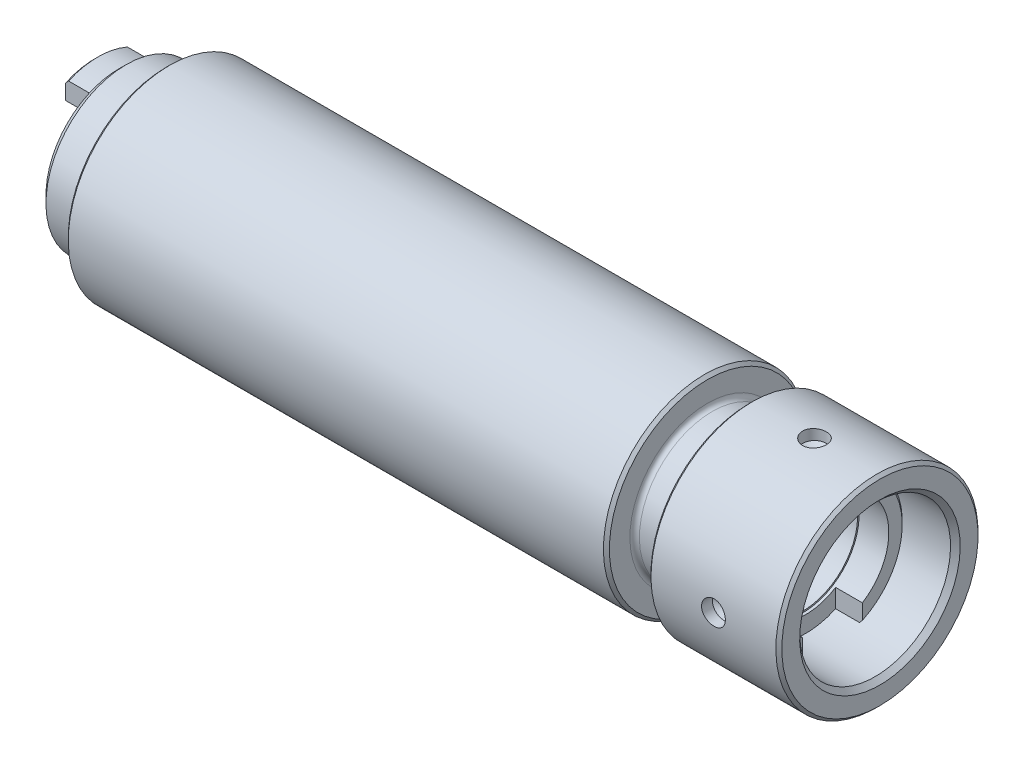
ISO-10303-21;
HEADER;
FILE_DESCRIPTION(('STEP AP214'),'2;1');
FILE_NAME('part.step','',(''),(''),'','','');
FILE_SCHEMA(('AUTOMOTIVE_DESIGN { 1 0 10303 214 1 1 1 1 }'));
ENDSEC;
DATA;
#1=APPLICATION_CONTEXT('core data for automotive mechanical design processes');
#2=APPLICATION_PROTOCOL_DEFINITION('international standard','automotive_design',2000,#1);
#3=PRODUCT_CONTEXT('',#1,'mechanical');
#4=PRODUCT('Part','Part','',(#3));
#5=PRODUCT_RELATED_PRODUCT_CATEGORY('part','',(#4));
#6=PRODUCT_DEFINITION_FORMATION('','',#4);
#7=PRODUCT_DEFINITION_CONTEXT('part definition',#1,'design');
#8=PRODUCT_DEFINITION('design','',#6,#7);
#9=PRODUCT_DEFINITION_SHAPE('','',#8);
#10=(LENGTH_UNIT() NAMED_UNIT(*) SI_UNIT(.MILLI.,.METRE.));
#11=(NAMED_UNIT(*) PLANE_ANGLE_UNIT() SI_UNIT($,.RADIAN.));
#12=(NAMED_UNIT(*) SI_UNIT($,.STERADIAN.) SOLID_ANGLE_UNIT());
#13=UNCERTAINTY_MEASURE_WITH_UNIT(LENGTH_MEASURE(1.E-05),#10,'distance_accuracy_value','');
#14=(GEOMETRIC_REPRESENTATION_CONTEXT(3) GLOBAL_UNCERTAINTY_ASSIGNED_CONTEXT((#13)) GLOBAL_UNIT_ASSIGNED_CONTEXT((#10,
#11,#12)) REPRESENTATION_CONTEXT('',''));
#15=CARTESIAN_POINT('',(0.,0.,0.));
#16=DIRECTION('',(0.,0.,1.));
#17=DIRECTION('',(1.,0.,0.));
#18=AXIS2_PLACEMENT_3D('',#15,#16,#17);
#19=CARTESIAN_POINT('',(120.,0.,0.));
#20=DIRECTION('',(1.,0.,0.));
#21=DIRECTION('',(0.,1.,0.));
#22=AXIS2_PLACEMENT_3D('',#19,#20,#21);
#23=CYLINDRICAL_SURFACE('',#22,17.);
#24=CARTESIAN_POINT('',(98.5,0.,0.));
#25=DIRECTION('',(1.,0.,0.));
#26=DIRECTION('',(0.,1.,0.));
#27=AXIS2_PLACEMENT_3D('',#24,#25,#26);
#28=CIRCLE('',#27,17.);
#29=CARTESIAN_POINT('',(98.5,17.,0.));
#30=VERTEX_POINT('',#29);
#31=EDGE_CURVE('E245',#30,#30,#28,.T.);
#32=ORIENTED_EDGE('',*,*,#31,.T.);
#33=EDGE_LOOP('',(#32));
#34=FACE_BOUND('',#33,.T.);
#35=CARTESIAN_POINT('',(111.,0.,17.));
#36=CARTESIAN_POINT('',(110.99999521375,-0.111926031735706,16.9999985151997));
#37=CARTESIAN_POINT('',(110.990572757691,-0.223923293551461,16.9988829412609));
#38=CARTESIAN_POINT('',(110.953131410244,-0.444804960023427,16.9945399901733));
#39=CARTESIAN_POINT('',(110.925092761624,-0.553685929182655,16.9913103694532));
#40=CARTESIAN_POINT('',(110.85125340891,-0.765105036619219,16.9831033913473));
#41=CARTESIAN_POINT('',(110.805464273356,-0.867647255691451,16.9781271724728));
#42=CARTESIAN_POINT('',(110.69744816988,-1.06357111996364,16.9669813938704));
#43=CARTESIAN_POINT('',(110.635224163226,-1.15695441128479,16.9608120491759));
#44=CARTESIAN_POINT('',(110.495778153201,-1.33238781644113,16.9479357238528));
#45=CARTESIAN_POINT('',(110.418491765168,-1.41438659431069,16.9412265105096));
#46=CARTESIAN_POINT('',(110.251252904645,-1.5642814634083,16.9280447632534));
#47=CARTESIAN_POINT('',(110.16129980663,-1.63217685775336,16.921572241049));
#48=CARTESIAN_POINT('',(109.97095085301,-1.75212620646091,16.9095745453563));
#49=CARTESIAN_POINT('',(109.870524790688,-1.80413253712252,16.9040522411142));
#50=CARTESIAN_POINT('',(109.662288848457,-1.890523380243,16.8946092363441));
#51=CARTESIAN_POINT('',(109.554479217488,-1.92490848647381,16.8906884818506));
#52=CARTESIAN_POINT('',(109.335066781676,-1.97492589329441,16.8849135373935));
#53=CARTESIAN_POINT('',(109.223483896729,-1.99064446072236,16.8830498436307));
#54=CARTESIAN_POINT('',(108.999249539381,-2.00314945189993,16.881570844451));
#55=CARTESIAN_POINT('',(108.88659810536,-1.99993655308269,16.8819554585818));
#56=CARTESIAN_POINT('',(108.664023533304,-1.97474071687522,16.8849209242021));
#57=CARTESIAN_POINT('',(108.554089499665,-1.9528525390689,16.8874906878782));
#58=CARTESIAN_POINT('',(108.339465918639,-1.89107519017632,16.8945196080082));
#59=CARTESIAN_POINT('',(108.234776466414,-1.85118569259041,16.8989787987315));
#60=CARTESIAN_POINT('',(108.033317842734,-1.75443530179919,16.9092967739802));
#61=CARTESIAN_POINT('',(107.936568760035,-1.69753295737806,16.9151589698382));
#62=CARTESIAN_POINT('',(107.753957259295,-1.56840181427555,16.927619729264));
#63=CARTESIAN_POINT('',(107.668095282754,-1.49617239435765,16.9342183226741));
#64=CARTESIAN_POINT('',(107.509145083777,-1.33791096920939,16.9474577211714));
#65=CARTESIAN_POINT('',(107.436138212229,-1.2517972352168,16.9540985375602));
#66=CARTESIAN_POINT('',(107.305603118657,-1.06849379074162,16.9666362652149));
#67=CARTESIAN_POINT('',(107.248074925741,-0.971304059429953,16.9725331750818));
#68=CARTESIAN_POINT('',(107.150131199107,-0.768546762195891,16.9829217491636));
#69=CARTESIAN_POINT('',(107.10972045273,-0.662976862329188,16.9874130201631));
#70=CARTESIAN_POINT('',(107.047221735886,-0.446485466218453,16.9944805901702));
#71=CARTESIAN_POINT('',(107.025133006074,-0.335564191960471,16.9970569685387));
#72=CARTESIAN_POINT('',(107.000010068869,-0.112222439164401,16.9999941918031));
#73=CARTESIAN_POINT('',(106.996863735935,0.000185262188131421,17.0003680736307));
#74=CARTESIAN_POINT('',(107.009419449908,0.223926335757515,16.9988933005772));
#75=CARTESIAN_POINT('',(107.025121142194,0.335259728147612,16.997044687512));
#76=CARTESIAN_POINT('',(107.074834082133,0.55336327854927,16.9913408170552));
#77=CARTESIAN_POINT('',(107.108792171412,0.66014571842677,16.9874913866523));
#78=CARTESIAN_POINT('',(107.193998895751,0.866499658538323,16.978217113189));
#79=CARTESIAN_POINT('',(107.245248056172,0.966070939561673,16.9727922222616));
#80=CARTESIAN_POINT('',(107.363855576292,1.15567883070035,16.9609399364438));
#81=CARTESIAN_POINT('',(107.431286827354,1.24566955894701,16.9545080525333));
#82=CARTESIAN_POINT('',(107.580240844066,1.41309578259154,16.9413761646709));
#83=CARTESIAN_POINT('',(107.661764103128,1.49053083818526,16.9346761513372));
#84=CARTESIAN_POINT('',(107.837080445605,1.63104275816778,16.9217232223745));
#85=CARTESIAN_POINT('',(107.930933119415,1.69404552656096,16.9154727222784));
#86=CARTESIAN_POINT('',(108.127953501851,1.80339337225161,16.9041653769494));
#87=CARTESIAN_POINT('',(108.231121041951,1.84973875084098,16.8991085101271));
#88=CARTESIAN_POINT('',(108.443598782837,1.92433498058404,16.8907770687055));
#89=CARTESIAN_POINT('',(108.552893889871,1.95262833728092,16.8874983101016));
#90=CARTESIAN_POINT('',(108.774724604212,1.99045460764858,16.8830820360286));
#91=CARTESIAN_POINT('',(108.887260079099,1.99998828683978,16.8819444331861));
#92=CARTESIAN_POINT('',(109.111640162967,2.00001162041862,16.8819416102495));
#93=CARTESIAN_POINT('',(109.22348477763,1.99061767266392,16.88306250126));
#94=CARTESIAN_POINT('',(109.443994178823,1.95329812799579,16.8874205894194));
#95=CARTESIAN_POINT('',(109.552658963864,1.92537252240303,16.8906577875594));
#96=CARTESIAN_POINT('',(109.763713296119,1.85181744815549,16.8988795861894));
#97=CARTESIAN_POINT('',(109.866104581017,1.80619290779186,16.9038637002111));
#98=CARTESIAN_POINT('',(110.061796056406,1.69854661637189,16.9150186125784));
#99=CARTESIAN_POINT('',(110.155096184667,1.6365247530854,16.9211894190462));
#100=CARTESIAN_POINT('',(110.330552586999,1.49741057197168,16.9340679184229));
#101=CARTESIAN_POINT('',(110.412639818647,1.42023144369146,16.9407785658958));
#102=CARTESIAN_POINT('',(110.56274417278,1.25317277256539,16.9539542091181));
#103=CARTESIAN_POINT('',(110.630757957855,1.16329022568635,16.9604191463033));
#104=CARTESIAN_POINT('',(110.750976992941,0.973031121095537,16.9723987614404));
#105=CARTESIAN_POINT('',(110.803127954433,0.872620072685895,16.9779101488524));
#106=CARTESIAN_POINT('',(110.889755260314,0.664459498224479,16.9873277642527));
#107=CARTESIAN_POINT('',(110.924251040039,0.55671819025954,16.9912357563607));
#108=CARTESIAN_POINT('',(110.966221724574,0.373668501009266,16.9960514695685));
#109=CARTESIAN_POINT('',(110.978870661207,0.299519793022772,16.9975250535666));
#110=CARTESIAN_POINT('',(110.995761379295,0.15025808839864,16.9994998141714));
#111=CARTESIAN_POINT('',(111.000003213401,0.0751450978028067,17.0000009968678));
#112=CARTESIAN_POINT('',(111.,0.,17.));
#113=B_SPLINE_CURVE_WITH_KNOTS('',3,(#35,#36,#37,#38,#39,#40,#41,#42,#43,#44,#45,#46,#47,#48,
#49,#50,#51,#52,#53,#54,#55,#56,#57,#58,#59,#60,#61,#62,#63,#64,#65,#66,#67,#68,#69,#70,#71,#72,
#73,#74,#75,#76,#77,#78,#79,#80,#81,#82,#83,#84,#85,#86,#87,#88,#89,#90,#91,#92,#93,#94,#95,#96,
#97,#98,#99,#100,#101,#102,#103,#104,#105,#106,#107,#108,#109,#110,#111,#112),.UNSPECIFIED.,.T.,
.F.,(4,2,2,2,2,2,2,2,2,2,2,2,2,2,2,2,2,2,2,2,2,2,2,2,2,2,2,2,2,2,2,2,2,2,2,2,2,2,4),(0.,
0.335503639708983,0.671363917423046,1.00700567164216,1.3425869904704,1.67963553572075,
2.01670073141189,2.35476650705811,2.69282089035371,3.02930680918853,3.36578068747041,
3.70055735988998,4.03534010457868,4.37094527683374,4.70656405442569,5.04423583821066,
5.38190825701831,5.71967505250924,6.05742784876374,6.39317940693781,6.72892464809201,
7.06369753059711,7.39848058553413,7.73480093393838,8.07113306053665,8.40915505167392,
8.7471709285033,9.08438794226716,9.42159119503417,9.75672710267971,10.0918631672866,
10.426905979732,10.7619510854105,11.0989742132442,11.4360771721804,11.7743211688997,
12.1121920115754,12.3374444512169,12.5626954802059),.UNSPECIFIED.);
#114=CARTESIAN_POINT('',(111.,0.,17.));
#115=VERTEX_POINT('',#114);
#116=EDGE_CURVE('E27',#115,#115,#113,.T.);
#117=ORIENTED_EDGE('',*,*,#116,.T.);
#118=EDGE_LOOP('',(#117));
#119=FACE_BOUND('',#118,.T.);
#120=CARTESIAN_POINT('',(111.,17.,0.));
#121=CARTESIAN_POINT('',(110.99999521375,16.9999985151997,0.111926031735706));
#122=CARTESIAN_POINT('',(110.990572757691,16.9988829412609,0.223923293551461));
#123=CARTESIAN_POINT('',(110.953131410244,16.9945399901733,0.444804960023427));
#124=CARTESIAN_POINT('',(110.925092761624,16.9913103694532,0.553685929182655));
#125=CARTESIAN_POINT('',(110.85125340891,16.9831033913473,0.765105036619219));
#126=CARTESIAN_POINT('',(110.805464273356,16.9781271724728,0.867647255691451));
#127=CARTESIAN_POINT('',(110.69744816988,16.9669813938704,1.06357111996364));
#128=CARTESIAN_POINT('',(110.635224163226,16.9608120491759,1.15695441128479));
#129=CARTESIAN_POINT('',(110.495778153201,16.9479357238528,1.33238781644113));
#130=CARTESIAN_POINT('',(110.418491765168,16.9412265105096,1.41438659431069));
#131=CARTESIAN_POINT('',(110.251252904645,16.9280447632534,1.5642814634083));
#132=CARTESIAN_POINT('',(110.16129980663,16.921572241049,1.63217685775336));
#133=CARTESIAN_POINT('',(109.97095085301,16.9095745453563,1.75212620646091));
#134=CARTESIAN_POINT('',(109.870524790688,16.9040522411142,1.80413253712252));
#135=CARTESIAN_POINT('',(109.662288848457,16.8946092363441,1.890523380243));
#136=CARTESIAN_POINT('',(109.554479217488,16.8906884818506,1.92490848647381));
#137=CARTESIAN_POINT('',(109.335066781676,16.8849135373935,1.97492589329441));
#138=CARTESIAN_POINT('',(109.223483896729,16.8830498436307,1.99064446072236));
#139=CARTESIAN_POINT('',(108.999249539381,16.881570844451,2.00314945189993));
#140=CARTESIAN_POINT('',(108.88659810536,16.8819554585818,1.99993655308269));
#141=CARTESIAN_POINT('',(108.664023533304,16.8849209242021,1.97474071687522));
#142=CARTESIAN_POINT('',(108.554089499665,16.8874906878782,1.9528525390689));
#143=CARTESIAN_POINT('',(108.339465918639,16.8945196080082,1.89107519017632));
#144=CARTESIAN_POINT('',(108.234776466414,16.8989787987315,1.85118569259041));
#145=CARTESIAN_POINT('',(108.033317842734,16.9092967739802,1.75443530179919));
#146=CARTESIAN_POINT('',(107.936568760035,16.9151589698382,1.69753295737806));
#147=CARTESIAN_POINT('',(107.753957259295,16.927619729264,1.56840181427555));
#148=CARTESIAN_POINT('',(107.668095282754,16.9342183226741,1.49617239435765));
#149=CARTESIAN_POINT('',(107.509145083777,16.9474577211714,1.33791096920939));
#150=CARTESIAN_POINT('',(107.436138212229,16.9540985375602,1.2517972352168));
#151=CARTESIAN_POINT('',(107.305603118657,16.9666362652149,1.06849379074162));
#152=CARTESIAN_POINT('',(107.248074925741,16.9725331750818,0.971304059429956));
#153=CARTESIAN_POINT('',(107.150131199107,16.9829217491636,0.768546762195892));
#154=CARTESIAN_POINT('',(107.10972045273,16.9874130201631,0.662976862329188));
#155=CARTESIAN_POINT('',(107.047221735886,16.9944805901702,0.446485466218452));
#156=CARTESIAN_POINT('',(107.025133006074,16.9970569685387,0.33556419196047));
#157=CARTESIAN_POINT('',(107.000010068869,16.9999941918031,0.1122224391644));
#158=CARTESIAN_POINT('',(106.996863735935,17.0003680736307,-0.000185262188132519));
#159=CARTESIAN_POINT('',(107.009419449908,16.9988933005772,-0.223926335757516));
#160=CARTESIAN_POINT('',(107.025121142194,16.997044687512,-0.335259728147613));
#161=CARTESIAN_POINT('',(107.074834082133,16.9913408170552,-0.553363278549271));
#162=CARTESIAN_POINT('',(107.108792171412,16.9874913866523,-0.660145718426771));
#163=CARTESIAN_POINT('',(107.193998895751,16.978217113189,-0.866499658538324));
#164=CARTESIAN_POINT('',(107.245248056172,16.9727922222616,-0.966070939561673));
#165=CARTESIAN_POINT('',(107.363855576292,16.9609399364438,-1.15567883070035));
#166=CARTESIAN_POINT('',(107.431286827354,16.9545080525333,-1.24566955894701));
#167=CARTESIAN_POINT('',(107.580240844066,16.9413761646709,-1.41309578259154));
#168=CARTESIAN_POINT('',(107.661764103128,16.9346761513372,-1.49053083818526));
#169=CARTESIAN_POINT('',(107.837080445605,16.9217232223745,-1.63104275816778));
#170=CARTESIAN_POINT('',(107.930933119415,16.9154727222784,-1.69404552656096));
#171=CARTESIAN_POINT('',(108.127953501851,16.9041653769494,-1.80339337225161));
#172=CARTESIAN_POINT('',(108.231121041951,16.8991085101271,-1.84973875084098));
#173=CARTESIAN_POINT('',(108.443598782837,16.8907770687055,-1.92433498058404));
#174=CARTESIAN_POINT('',(108.552893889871,16.8874983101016,-1.95262833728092));
#175=CARTESIAN_POINT('',(108.774724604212,16.8830820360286,-1.99045460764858));
#176=CARTESIAN_POINT('',(108.887260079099,16.8819444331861,-1.99998828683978));
#177=CARTESIAN_POINT('',(109.111640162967,16.8819416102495,-2.00001162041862));
#178=CARTESIAN_POINT('',(109.22348477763,16.88306250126,-1.99061767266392));
#179=CARTESIAN_POINT('',(109.443994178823,16.8874205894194,-1.95329812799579));
#180=CARTESIAN_POINT('',(109.552658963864,16.8906577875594,-1.92537252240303));
#181=CARTESIAN_POINT('',(109.763713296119,16.8988795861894,-1.85181744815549));
#182=CARTESIAN_POINT('',(109.866104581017,16.9038637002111,-1.80619290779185));
#183=CARTESIAN_POINT('',(110.061796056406,16.9150186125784,-1.69854661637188));
#184=CARTESIAN_POINT('',(110.155096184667,16.9211894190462,-1.63652475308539));
#185=CARTESIAN_POINT('',(110.330552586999,16.9340679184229,-1.49741057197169));
#186=CARTESIAN_POINT('',(110.412639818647,16.9407785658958,-1.42023144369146));
#187=CARTESIAN_POINT('',(110.56274417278,16.9539542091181,-1.25317277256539));
#188=CARTESIAN_POINT('',(110.630757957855,16.9604191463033,-1.16329022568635));
#189=CARTESIAN_POINT('',(110.750976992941,16.9723987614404,-0.973031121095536));
#190=CARTESIAN_POINT('',(110.803127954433,16.9779101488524,-0.872620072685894));
#191=CARTESIAN_POINT('',(110.889755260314,16.9873277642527,-0.664459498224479));
#192=CARTESIAN_POINT('',(110.924251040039,16.9912357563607,-0.55671819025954));
#193=CARTESIAN_POINT('',(110.966221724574,16.9960514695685,-0.373668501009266));
#194=CARTESIAN_POINT('',(110.978870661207,16.9975250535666,-0.299519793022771));
#195=CARTESIAN_POINT('',(110.995761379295,16.9994998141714,-0.150258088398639));
#196=CARTESIAN_POINT('',(111.000003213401,17.0000009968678,-0.0751450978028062));
#197=CARTESIAN_POINT('',(111.,17.,0.));
#198=B_SPLINE_CURVE_WITH_KNOTS('',3,(#120,#121,#122,#123,#124,#125,#126,#127,#128,#129,#130,
#131,#132,#133,#134,#135,#136,#137,#138,#139,#140,#141,#142,#143,#144,#145,#146,#147,#148,#149,
#150,#151,#152,#153,#154,#155,#156,#157,#158,#159,#160,#161,#162,#163,#164,#165,#166,#167,#168,
#169,#170,#171,#172,#173,#174,#175,#176,#177,#178,#179,#180,#181,#182,#183,#184,#185,#186,#187,
#188,#189,#190,#191,#192,#193,#194,#195,#196,#197),.UNSPECIFIED.,.T.,.F.,(4,2,2,2,2,2,2,2,2,2,2,
2,2,2,2,2,2,2,2,2,2,2,2,2,2,2,2,2,2,2,2,2,2,2,2,2,2,2,4),(0.,0.335503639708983,
0.671363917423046,1.00700567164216,1.3425869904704,1.67963553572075,2.01670073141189,
2.35476650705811,2.69282089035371,3.02930680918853,3.36578068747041,3.70055735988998,
4.03534010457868,4.37094527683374,4.70656405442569,5.04423583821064,5.38190825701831,
5.71967505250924,6.05742784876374,6.39317940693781,6.72892464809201,7.06369753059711,
7.39848058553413,7.73480093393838,8.07113306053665,8.40915505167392,8.7471709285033,
9.08438794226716,9.42159119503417,9.7567271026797,10.0918631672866,10.426905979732,
10.7619510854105,11.0989742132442,11.4360771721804,11.7743211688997,12.1121920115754,
12.3374444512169,12.5626954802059),.UNSPECIFIED.);
#199=CARTESIAN_POINT('',(111.,17.,0.));
#200=VERTEX_POINT('',#199);
#201=EDGE_CURVE('E205',#200,#200,#198,.T.);
#202=ORIENTED_EDGE('',*,*,#201,.T.);
#203=EDGE_LOOP('',(#202));
#204=FACE_BOUND('',#203,.T.);
#205=CARTESIAN_POINT('',(111.,-17.,0.));
#206=CARTESIAN_POINT('',(110.99999521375,-16.9999985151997,-0.111926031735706));
#207=CARTESIAN_POINT('',(110.990572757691,-16.9988829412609,-0.223923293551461));
#208=CARTESIAN_POINT('',(110.953131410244,-16.9945399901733,-0.444804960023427));
#209=CARTESIAN_POINT('',(110.925092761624,-16.9913103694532,-0.553685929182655));
#210=CARTESIAN_POINT('',(110.85125340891,-16.9831033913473,-0.765105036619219));
#211=CARTESIAN_POINT('',(110.805464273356,-16.9781271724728,-0.867647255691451));
#212=CARTESIAN_POINT('',(110.69744816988,-16.9669813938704,-1.06357111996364));
#213=CARTESIAN_POINT('',(110.635224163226,-16.9608120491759,-1.15695441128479));
#214=CARTESIAN_POINT('',(110.495778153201,-16.9479357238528,-1.33238781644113));
#215=CARTESIAN_POINT('',(110.418491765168,-16.9412265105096,-1.41438659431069));
#216=CARTESIAN_POINT('',(110.251252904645,-16.9280447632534,-1.5642814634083));
#217=CARTESIAN_POINT('',(110.16129980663,-16.921572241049,-1.63217685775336));
#218=CARTESIAN_POINT('',(109.97095085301,-16.9095745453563,-1.75212620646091));
#219=CARTESIAN_POINT('',(109.870524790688,-16.9040522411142,-1.80413253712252));
#220=CARTESIAN_POINT('',(109.662288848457,-16.8946092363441,-1.890523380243));
#221=CARTESIAN_POINT('',(109.554479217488,-16.8906884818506,-1.92490848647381));
#222=CARTESIAN_POINT('',(109.335066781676,-16.8849135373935,-1.97492589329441));
#223=CARTESIAN_POINT('',(109.223483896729,-16.8830498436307,-1.99064446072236));
#224=CARTESIAN_POINT('',(108.999249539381,-16.881570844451,-2.00314945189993));
#225=CARTESIAN_POINT('',(108.88659810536,-16.8819554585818,-1.99993655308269));
#226=CARTESIAN_POINT('',(108.664023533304,-16.8849209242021,-1.97474071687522));
#227=CARTESIAN_POINT('',(108.554089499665,-16.8874906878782,-1.9528525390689));
#228=CARTESIAN_POINT('',(108.339465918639,-16.8945196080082,-1.89107519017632));
#229=CARTESIAN_POINT('',(108.234776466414,-16.8989787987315,-1.85118569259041));
#230=CARTESIAN_POINT('',(108.033317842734,-16.9092967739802,-1.75443530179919));
#231=CARTESIAN_POINT('',(107.936568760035,-16.9151589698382,-1.69753295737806));
#232=CARTESIAN_POINT('',(107.753957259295,-16.927619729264,-1.56840181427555));
#233=CARTESIAN_POINT('',(107.668095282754,-16.9342183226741,-1.49617239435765));
#234=CARTESIAN_POINT('',(107.509145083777,-16.9474577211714,-1.33791096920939));
#235=CARTESIAN_POINT('',(107.436138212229,-16.9540985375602,-1.2517972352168));
#236=CARTESIAN_POINT('',(107.305603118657,-16.9666362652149,-1.06849379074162));
#237=CARTESIAN_POINT('',(107.248074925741,-16.9725331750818,-0.971304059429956));
#238=CARTESIAN_POINT('',(107.150131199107,-16.9829217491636,-0.768546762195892));
#239=CARTESIAN_POINT('',(107.10972045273,-16.9874130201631,-0.662976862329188));
#240=CARTESIAN_POINT('',(107.047221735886,-16.9944805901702,-0.446485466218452));
#241=CARTESIAN_POINT('',(107.025133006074,-16.9970569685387,-0.33556419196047));
#242=CARTESIAN_POINT('',(107.000010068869,-16.9999941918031,-0.1122224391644));
#243=CARTESIAN_POINT('',(106.996863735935,-17.0003680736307,0.000185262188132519));
#244=CARTESIAN_POINT('',(107.009419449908,-16.9988933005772,0.223926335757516));
#245=CARTESIAN_POINT('',(107.025121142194,-16.997044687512,0.335259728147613));
#246=CARTESIAN_POINT('',(107.074834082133,-16.9913408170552,0.553363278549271));
#247=CARTESIAN_POINT('',(107.108792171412,-16.9874913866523,0.660145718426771));
#248=CARTESIAN_POINT('',(107.193998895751,-16.978217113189,0.866499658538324));
#249=CARTESIAN_POINT('',(107.245248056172,-16.9727922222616,0.966070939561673));
#250=CARTESIAN_POINT('',(107.363855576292,-16.9609399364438,1.15567883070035));
#251=CARTESIAN_POINT('',(107.431286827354,-16.9545080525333,1.24566955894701));
#252=CARTESIAN_POINT('',(107.580240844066,-16.9413761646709,1.41309578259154));
#253=CARTESIAN_POINT('',(107.661764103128,-16.9346761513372,1.49053083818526));
#254=CARTESIAN_POINT('',(107.837080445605,-16.9217232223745,1.63104275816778));
#255=CARTESIAN_POINT('',(107.930933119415,-16.9154727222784,1.69404552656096));
#256=CARTESIAN_POINT('',(108.127953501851,-16.9041653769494,1.80339337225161));
#257=CARTESIAN_POINT('',(108.231121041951,-16.8991085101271,1.84973875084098));
#258=CARTESIAN_POINT('',(108.443598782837,-16.8907770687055,1.92433498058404));
#259=CARTESIAN_POINT('',(108.552893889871,-16.8874983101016,1.95262833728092));
#260=CARTESIAN_POINT('',(108.774724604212,-16.8830820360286,1.99045460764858));
#261=CARTESIAN_POINT('',(108.887260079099,-16.8819444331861,1.99998828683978));
#262=CARTESIAN_POINT('',(109.111640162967,-16.8819416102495,2.00001162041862));
#263=CARTESIAN_POINT('',(109.22348477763,-16.88306250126,1.99061767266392));
#264=CARTESIAN_POINT('',(109.443994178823,-16.8874205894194,1.95329812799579));
#265=CARTESIAN_POINT('',(109.552658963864,-16.8906577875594,1.92537252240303));
#266=CARTESIAN_POINT('',(109.763713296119,-16.8988795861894,1.85181744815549));
#267=CARTESIAN_POINT('',(109.866104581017,-16.9038637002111,1.80619290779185));
#268=CARTESIAN_POINT('',(110.061796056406,-16.9150186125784,1.69854661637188));
#269=CARTESIAN_POINT('',(110.155096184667,-16.9211894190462,1.63652475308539));
#270=CARTESIAN_POINT('',(110.330552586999,-16.9340679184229,1.49741057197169));
#271=CARTESIAN_POINT('',(110.412639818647,-16.9407785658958,1.42023144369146));
#272=CARTESIAN_POINT('',(110.56274417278,-16.9539542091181,1.25317277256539));
#273=CARTESIAN_POINT('',(110.630757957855,-16.9604191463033,1.16329022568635));
#274=CARTESIAN_POINT('',(110.750976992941,-16.9723987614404,0.973031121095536));
#275=CARTESIAN_POINT('',(110.803127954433,-16.9779101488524,0.872620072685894));
#276=CARTESIAN_POINT('',(110.889755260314,-16.9873277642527,0.664459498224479));
#277=CARTESIAN_POINT('',(110.924251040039,-16.9912357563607,0.55671819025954));
#278=CARTESIAN_POINT('',(110.966221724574,-16.9960514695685,0.373668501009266));
#279=CARTESIAN_POINT('',(110.978870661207,-16.9975250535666,0.299519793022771));
#280=CARTESIAN_POINT('',(110.995761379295,-16.9994998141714,0.150258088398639));
#281=CARTESIAN_POINT('',(111.000003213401,-17.0000009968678,0.0751450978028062));
#282=CARTESIAN_POINT('',(111.,-17.,0.));
#283=B_SPLINE_CURVE_WITH_KNOTS('',3,(#205,#206,#207,#208,#209,#210,#211,#212,#213,#214,#215,
#216,#217,#218,#219,#220,#221,#222,#223,#224,#225,#226,#227,#228,#229,#230,#231,#232,#233,#234,
#235,#236,#237,#238,#239,#240,#241,#242,#243,#244,#245,#246,#247,#248,#249,#250,#251,#252,#253,
#254,#255,#256,#257,#258,#259,#260,#261,#262,#263,#264,#265,#266,#267,#268,#269,#270,#271,#272,
#273,#274,#275,#276,#277,#278,#279,#280,#281,#282),.UNSPECIFIED.,.T.,.F.,(4,2,2,2,2,2,2,2,2,2,2,
2,2,2,2,2,2,2,2,2,2,2,2,2,2,2,2,2,2,2,2,2,2,2,2,2,2,2,4),(0.,0.335503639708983,
0.671363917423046,1.00700567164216,1.3425869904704,1.67963553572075,2.01670073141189,
2.35476650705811,2.69282089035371,3.02930680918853,3.36578068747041,3.70055735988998,
4.03534010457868,4.37094527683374,4.70656405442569,5.04423583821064,5.38190825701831,
5.71967505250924,6.05742784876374,6.39317940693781,6.72892464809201,7.06369753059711,
7.39848058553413,7.73480093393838,8.07113306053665,8.40915505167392,8.7471709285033,
9.08438794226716,9.42159119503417,9.7567271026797,10.0918631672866,10.426905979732,
10.7619510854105,11.0989742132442,11.4360771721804,11.7743211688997,12.1121920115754,
12.3374444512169,12.5626954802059),.UNSPECIFIED.);
#284=CARTESIAN_POINT('',(111.,-17.,0.));
#285=VERTEX_POINT('',#284);
#286=EDGE_CURVE('E212',#285,#285,#283,.T.);
#287=ORIENTED_EDGE('',*,*,#286,.T.);
#288=EDGE_LOOP('',(#287));
#289=FACE_BOUND('',#288,.T.);
#290=CARTESIAN_POINT('',(119.5,0.,0.));
#291=DIRECTION('',(1.,0.,0.));
#292=DIRECTION('',(0.,1.,0.));
#293=AXIS2_PLACEMENT_3D('',#290,#291,#292);
#294=CIRCLE('',#293,17.);
#295=CARTESIAN_POINT('',(119.5,17.,0.));
#296=VERTEX_POINT('',#295);
#297=EDGE_CURVE('E248',#296,#296,#294,.T.);
#298=ORIENTED_EDGE('',*,*,#297,.F.);
#299=EDGE_LOOP('',(#298));
#300=FACE_BOUND('',#299,.T.);
#301=CARTESIAN_POINT('',(109.,2.,-16.8819430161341));
#302=CARTESIAN_POINT('',(108.888076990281,1.99999521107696,-16.8819445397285));
#303=CARTESIAN_POINT('',(108.776082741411,1.99057324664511,-16.8830680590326));
#304=CARTESIAN_POINT('',(108.55520733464,1.95313402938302,-16.8874393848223));
#305=CARTESIAN_POINT('',(108.446329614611,1.92509700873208,-16.8906894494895));
#306=CARTESIAN_POINT('',(108.234917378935,1.85126241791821,-16.898940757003));
#307=CARTESIAN_POINT('',(108.132378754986,1.80547649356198,-16.9039408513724));
#308=CARTESIAN_POINT('',(107.936460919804,1.69746795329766,-16.9151274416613));
#309=CARTESIAN_POINT('',(107.843080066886,1.63524829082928,-16.9213137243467));
#310=CARTESIAN_POINT('',(107.667643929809,1.49580667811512,-16.9342101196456));
#311=CARTESIAN_POINT('',(107.585640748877,1.41851937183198,-16.9409224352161));
#312=CARTESIAN_POINT('',(107.435737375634,1.25127682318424,-16.9540947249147));
#313=CARTESIAN_POINT('',(107.367837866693,1.16132096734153,-16.9605546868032));
#314=CARTESIAN_POINT('',(107.247884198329,0.970969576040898,-16.972516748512));
#315=CARTESIAN_POINT('',(107.195876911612,0.870544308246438,-16.9780159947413));
#316=CARTESIAN_POINT('',(107.109484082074,0.662310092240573,-16.9874128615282));
#317=CARTESIAN_POINT('',(107.075097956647,0.554501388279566,-16.9913105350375));
#318=CARTESIAN_POINT('',(107.025078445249,0.335091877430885,-16.9970495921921));
#319=CARTESIAN_POINT('',(107.009358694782,0.223511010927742,-16.9989004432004));
#320=CARTESIAN_POINT('',(106.996850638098,-0.000719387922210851,-17.0003696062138));
#321=CARTESIAN_POINT('',(107.000061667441,-0.1133688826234,-16.9999879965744));
#322=CARTESIAN_POINT('',(107.025254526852,-0.335951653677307,-16.9970429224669));
#323=CARTESIAN_POINT('',(107.047143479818,-0.445895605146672,-16.9944902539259));
#324=CARTESIAN_POINT('',(107.10892581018,-0.660538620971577,-16.9875020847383));
#325=CARTESIAN_POINT('',(107.148819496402,-0.765237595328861,-16.9830665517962));
#326=CARTESIAN_POINT('',(107.245578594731,-0.966707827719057,-16.972792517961));
#327=CARTESIAN_POINT('',(107.302484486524,-1.06345946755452,-16.9669506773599));
#328=CARTESIAN_POINT('',(107.43162321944,-1.2460745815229,-16.9545182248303));
#329=CARTESIAN_POINT('',(107.503856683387,-1.33193761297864,-16.9479275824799));
#330=CARTESIAN_POINT('',(107.662120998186,-1.49088330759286,-16.9346886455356));
#331=CARTESIAN_POINT('',(107.748232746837,-1.56388543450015,-16.9280402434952));
#332=CARTESIAN_POINT('',(107.931530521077,-1.69441189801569,-16.915474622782));
#333=CARTESIAN_POINT('',(108.028716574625,-1.75193619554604,-16.9095574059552));
#334=CARTESIAN_POINT('',(108.231472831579,-1.84987711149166,-16.8991240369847));
#335=CARTESIAN_POINT('',(108.337045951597,-1.89028774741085,-16.8946083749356));
#336=CARTESIAN_POINT('',(108.553544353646,-1.95278525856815,-16.8874991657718));
#337=CARTESIAN_POINT('',(108.664469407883,-1.97487291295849,-16.8849055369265));
#338=CARTESIAN_POINT('',(108.887812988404,-1.99999178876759,-16.8819487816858));
#339=CARTESIAN_POINT('',(109.000218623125,-2.00313613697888,-16.8815724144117));
#340=CARTESIAN_POINT('',(109.223955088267,-1.99057719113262,-16.8830578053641));
#341=CARTESIAN_POINT('',(109.335285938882,-1.97487425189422,-16.8849195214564));
#342=CARTESIAN_POINT('',(109.553376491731,-1.92516154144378,-16.8906592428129));
#343=CARTESIAN_POINT('',(109.660148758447,-1.89120613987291,-16.8945312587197));
#344=CARTESIAN_POINT('',(109.866483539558,-1.80600819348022,-16.9038504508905));
#345=CARTESIAN_POINT('',(109.966045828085,-1.75476510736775,-16.9092976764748));
#346=CARTESIAN_POINT('',(110.155647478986,-1.63616659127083,-16.9211853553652));
#347=CARTESIAN_POINT('',(110.245639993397,-1.56873672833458,-16.9276303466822));
#348=CARTESIAN_POINT('',(110.413070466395,-1.4197844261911,-16.9407729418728));
#349=CARTESIAN_POINT('',(110.490507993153,-1.33826150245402,-16.9474705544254));
#350=CARTESIAN_POINT('',(110.631025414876,-1.16294410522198,-16.9604042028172));
#351=CARTESIAN_POINT('',(110.694031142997,-1.06908997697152,-16.9666377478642));
#352=CARTESIAN_POINT('',(110.80338417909,-0.872065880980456,-16.9779039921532));
#353=CARTESIAN_POINT('',(110.849731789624,-0.768896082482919,-16.9829367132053));
#354=CARTESIAN_POINT('',(110.924329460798,-0.556419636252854,-16.9912231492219));
#355=CARTESIAN_POINT('',(110.952622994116,-0.447128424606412,-16.9944811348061));
#356=CARTESIAN_POINT('',(110.990450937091,-0.225305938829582,-16.9988686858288));
#357=CARTESIAN_POINT('',(110.999986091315,-0.112774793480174,-16.9999983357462));
#358=CARTESIAN_POINT('',(111.000013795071,0.111607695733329,-17.0000016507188));
#359=CARTESIAN_POINT('',(110.990620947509,0.223459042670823,-16.9988888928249));
#360=CARTESIAN_POINT('',(110.953301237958,0.443982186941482,-16.9945593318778));
#361=CARTESIAN_POINT('',(110.925374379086,0.552653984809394,-16.9913425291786));
#362=CARTESIAN_POINT('',(110.851814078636,0.763722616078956,-16.9831648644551));
#363=CARTESIAN_POINT('',(110.806185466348,0.866121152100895,-16.9782044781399));
#364=CARTESIAN_POINT('',(110.698528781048,1.06182543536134,-16.9670900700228));
#365=CARTESIAN_POINT('',(110.636500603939,1.15513112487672,-16.9609360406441));
#366=CARTESIAN_POINT('',(110.497379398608,1.33058739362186,-16.9480775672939));
#367=CARTESIAN_POINT('',(110.420201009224,1.41267007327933,-16.9413701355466));
#368=CARTESIAN_POINT('',(110.253145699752,1.5627655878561,-16.9281852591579));
#369=CARTESIAN_POINT('',(110.163265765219,1.63077507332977,-16.9217078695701));
#370=CARTESIAN_POINT('',(109.973008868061,1.75098938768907,-16.9096927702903));
#371=CARTESIAN_POINT('',(109.872596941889,1.80313917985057,-16.9041583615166));
#372=CARTESIAN_POINT('',(109.664434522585,1.88976405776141,-16.894694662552));
#373=CARTESIAN_POINT('',(109.556692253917,1.92425859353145,-16.8907636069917));
#374=CARTESIAN_POINT('',(109.373645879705,1.96622583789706,-16.8859179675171));
#375=CARTESIAN_POINT('',(109.299501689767,1.97887322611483,-16.8844346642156));
#376=CARTESIAN_POINT('',(109.150249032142,1.99576188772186,-16.8824466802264));
#377=CARTESIAN_POINT('',(109.075140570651,2.00000321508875,-16.8819419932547));
#378=CARTESIAN_POINT('',(109.,2.,-16.8819430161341));
#379=B_SPLINE_CURVE_WITH_KNOTS('',3,(#301,#302,#303,#304,#305,#306,#307,#308,#309,#310,#311,
#312,#313,#314,#315,#316,#317,#318,#319,#320,#321,#322,#323,#324,#325,#326,#327,#328,#329,#330,
#331,#332,#333,#334,#335,#336,#337,#338,#339,#340,#341,#342,#343,#344,#345,#346,#347,#348,#349,
#350,#351,#352,#353,#354,#355,#356,#357,#358,#359,#360,#361,#362,#363,#364,#365,#366,#367,#368,
#369,#370,#371,#372,#373,#374,#375,#376,#377,#378),.UNSPECIFIED.,.T.,.F.,(4,2,2,2,2,2,2,2,2,2,2,
2,2,2,2,2,2,2,2,2,2,2,2,2,2,2,2,2,2,2,2,2,2,2,2,2,2,2,4),(0.,0.335494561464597,
0.671345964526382,1.00697737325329,1.34254850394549,1.67960893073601,2.01668568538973,
2.35474723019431,2.69279759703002,3.02927772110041,3.36574603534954,3.70055092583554,
4.0353615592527,4.37097528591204,4.7066026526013,5.04426231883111,5.38192283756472,
5.71970129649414,6.05746539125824,6.39321039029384,6.7289490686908,7.06369316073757,
7.39844773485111,7.7347721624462,8.07110815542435,8.40913566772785,8.74715704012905,
9.08436138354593,9.42155234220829,9.75670785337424,10.0918633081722,10.4269273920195,
10.7619936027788,11.0990048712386,11.4360962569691,11.7743444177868,12.1122191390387,
12.3374580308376,12.5626954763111),.UNSPECIFIED.);
#380=CARTESIAN_POINT('',(109.,2.,-16.8819430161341));
#381=VERTEX_POINT('',#380);
#382=EDGE_CURVE('E9',#381,#381,#379,.T.);
#383=ORIENTED_EDGE('',*,*,#382,.T.);
#384=EDGE_LOOP('',(#383));
#385=FACE_BOUND('',#384,.T.);
#386=ADVANCED_FACE('F14',(#34,#119,#204,#289,#300,#385),#23,.T.);
#387=CARTESIAN_POINT('',(-12.,0.,11.75));
#388=DIRECTION('',(-1.,0.,0.));
#389=DIRECTION('',(0.,-1.,0.));
#390=AXIS2_PLACEMENT_3D('',#387,#388,#389);
#391=PLANE('',#390);
#392=DIRECTION('',(0.,-1.,0.));
#393=VECTOR('',#392,1.);
#394=CARTESIAN_POINT('',(-12.,12.5,4.95));
#395=LINE('',#394,#393);
#396=CARTESIAN_POINT('',(-12.,-8.10848321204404,4.95));
#397=VERTEX_POINT('',#396);
#398=CARTESIAN_POINT('',(-12.,-10.6564534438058,4.95));
#399=VERTEX_POINT('',#398);
#400=EDGE_CURVE('E42',#397,#399,#395,.T.);
#401=ORIENTED_EDGE('',*,*,#400,.F.);
#402=CARTESIAN_POINT('',(-12.,0.,0.));
#403=DIRECTION('',(1.,0.,0.));
#404=DIRECTION('',(0.,1.,0.));
#405=AXIS2_PLACEMENT_3D('',#402,#403,#404);
#406=CIRCLE('',#405,9.5);
#407=CARTESIAN_POINT('',(-12.,-8.10848321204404,-4.95));
#408=VERTEX_POINT('',#407);
#409=EDGE_CURVE('E452',#397,#408,#406,.T.);
#410=ORIENTED_EDGE('',*,*,#409,.T.);
#411=DIRECTION('',(0.,1.,0.));
#412=VECTOR('',#411,1.);
#413=CARTESIAN_POINT('',(-12.,-12.5,-4.95));
#414=LINE('',#413,#412);
#415=CARTESIAN_POINT('',(-12.,-10.6564534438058,-4.95));
#416=VERTEX_POINT('',#415);
#417=EDGE_CURVE('E288',#416,#408,#414,.T.);
#418=ORIENTED_EDGE('',*,*,#417,.F.);
#419=CARTESIAN_POINT('',(-12.,0.,0.));
#420=DIRECTION('',(1.,0.,0.));
#421=DIRECTION('',(0.,1.,0.));
#422=AXIS2_PLACEMENT_3D('',#419,#420,#421);
#423=CIRCLE('',#422,11.75);
#424=EDGE_CURVE('E378',#399,#416,#423,.T.);
#425=ORIENTED_EDGE('',*,*,#424,.F.);
#426=EDGE_LOOP('',(#401,#410,#418,#425));
#427=FACE_BOUND('',#426,.T.);
#428=ADVANCED_FACE('F184',(#427),#391,.T.);
#429=CARTESIAN_POINT('',(112.,0.,0.));
#430=DIRECTION('',(1.,0.,0.));
#431=DIRECTION('',(0.,1.,0.));
#432=AXIS2_PLACEMENT_3D('',#429,#430,#431);
#433=CYLINDRICAL_SURFACE('',#432,9.5);
#434=DIRECTION('',(1.,0.,0.));
#435=VECTOR('',#434,1.);
#436=CARTESIAN_POINT('',(112.,-8.10848321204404,4.95));
#437=LINE('',#436,#435);
#438=CARTESIAN_POINT('',(-8.,-8.10848321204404,4.95));
#439=VERTEX_POINT('',#438);
#440=EDGE_CURVE('E302',#439,#397,#437,.F.);
#441=ORIENTED_EDGE('',*,*,#440,.F.);
#442=CARTESIAN_POINT('',(-8.,0.,0.));
#443=DIRECTION('',(1.,0.,0.));
#444=DIRECTION('',(0.,1.,0.));
#445=AXIS2_PLACEMENT_3D('',#442,#443,#444);
#446=CIRCLE('',#445,9.5);
#447=CARTESIAN_POINT('',(-8.,-8.10848321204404,-4.95));
#448=VERTEX_POINT('',#447);
#449=EDGE_CURVE('E448',#439,#448,#446,.T.);
#450=ORIENTED_EDGE('',*,*,#449,.T.);
#451=DIRECTION('',(1.,0.,0.));
#452=VECTOR('',#451,1.);
#453=CARTESIAN_POINT('',(112.,-8.10848321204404,-4.95));
#454=LINE('',#453,#452);
#455=EDGE_CURVE('E296',#408,#448,#454,.T.);
#456=ORIENTED_EDGE('',*,*,#455,.F.);
#457=ORIENTED_EDGE('',*,*,#409,.F.);
#458=EDGE_LOOP('',(#441,#450,#456,#457));
#459=FACE_BOUND('',#458,.T.);
#460=ADVANCED_FACE('F190',(#459),#433,.F.);
#461=CARTESIAN_POINT('',(112.,0.,0.));
#462=DIRECTION('',(1.,0.,0.));
#463=DIRECTION('',(0.,1.,0.));
#464=AXIS2_PLACEMENT_3D('',#461,#462,#463);
#465=CYLINDRICAL_SURFACE('',#464,12.25);
#466=DIRECTION('',(1.,0.,0.));
#467=VECTOR('',#466,1.);
#468=CARTESIAN_POINT('',(112.,-11.2053558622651,4.95));
#469=LINE('',#468,#467);
#470=CARTESIAN_POINT('',(-11.5,-11.2053558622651,4.95));
#471=VERTEX_POINT('',#470);
#472=CARTESIAN_POINT('',(-8.,-11.2053558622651,4.95));
#473=VERTEX_POINT('',#472);
#474=EDGE_CURVE('E298',#471,#473,#469,.T.);
#475=ORIENTED_EDGE('',*,*,#474,.F.);
#476=CARTESIAN_POINT('',(-11.5,0.,0.));
#477=DIRECTION('',(1.,0.,0.));
#478=DIRECTION('',(0.,1.,0.));
#479=AXIS2_PLACEMENT_3D('',#476,#477,#478);
#480=CIRCLE('',#479,12.25);
#481=CARTESIAN_POINT('',(-11.5,-11.2053558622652,-4.95));
#482=VERTEX_POINT('',#481);
#483=EDGE_CURVE('E382',#471,#482,#480,.T.);
#484=ORIENTED_EDGE('',*,*,#483,.T.);
#485=DIRECTION('',(1.,0.,0.));
#486=VECTOR('',#485,1.);
#487=CARTESIAN_POINT('',(112.,-11.2053558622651,-4.95));
#488=LINE('',#487,#486);
#489=CARTESIAN_POINT('',(-8.,-11.2053558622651,-4.95));
#490=VERTEX_POINT('',#489);
#491=EDGE_CURVE('E292',#490,#482,#488,.F.);
#492=ORIENTED_EDGE('',*,*,#491,.F.);
#493=CARTESIAN_POINT('',(-8.,0.,0.));
#494=DIRECTION('',(1.,0.,0.));
#495=DIRECTION('',(0.,1.,0.));
#496=AXIS2_PLACEMENT_3D('',#493,#494,#495);
#497=CIRCLE('',#496,12.25);
#498=EDGE_CURVE('E387',#473,#490,#497,.T.);
#499=ORIENTED_EDGE('',*,*,#498,.F.);
#500=EDGE_LOOP('',(#475,#484,#492,#499));
#501=FACE_BOUND('',#500,.T.);
#502=ADVANCED_FACE('F493',(#501),#465,.T.);
#503=CARTESIAN_POINT('',(-11.5,0.,0.));
#504=DIRECTION('',(1.,0.,0.));
#505=DIRECTION('',(0.,1.,0.));
#506=AXIS2_PLACEMENT_3D('',#503,#504,#505);
#507=CONICAL_SURFACE('',#506,12.25,0.785398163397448);
#508=CARTESIAN_POINT('',(3.2032609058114,26.4948254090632,4.95));
#509=CARTESIAN_POINT('',(2.51381405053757,25.7934123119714,4.95));
#510=CARTESIAN_POINT('',(1.82480125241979,25.0915713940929,4.95));
#511=CARTESIAN_POINT('',(0.447152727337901,23.685855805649,4.95));
#512=CARTESIAN_POINT('',(-0.241481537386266,22.981979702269,4.95));
#513=CARTESIAN_POINT('',(-1.63178185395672,21.5577677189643,4.95));
#514=CARTESIAN_POINT('',(-2.3334145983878,20.8373993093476,4.95));
#515=CARTESIAN_POINT('',(-3.73364260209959,19.3954075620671,4.95));
#516=CARTESIAN_POINT('',(-4.43224050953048,18.6737867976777,4.95));
#517=CARTESIAN_POINT('',(-5.70449622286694,17.3540438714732,4.95));
#518=CARTESIAN_POINT('',(-6.27864062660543,16.7563911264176,4.95));
#519=CARTESIAN_POINT('',(-7.42418169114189,15.5582993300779,4.95));
#520=CARTESIAN_POINT('',(-7.9955779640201,14.9578599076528,4.95));
#521=CARTESIAN_POINT('',(-9.13703721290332,13.7504675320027,4.95));
#522=CARTESIAN_POINT('',(-9.70708198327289,13.1434973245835,4.95));
#523=CARTESIAN_POINT('',(-10.5575651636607,12.2290725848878,4.95));
#524=CARTESIAN_POINT('',(-10.840222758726,11.923682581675,4.95));
#525=CARTESIAN_POINT('',(-11.4036901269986,11.3112036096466,4.95));
#526=CARTESIAN_POINT('',(-11.6844999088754,11.0041146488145,4.95));
#527=CARTESIAN_POINT('',(-12.2386008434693,10.3935530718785,4.95));
#528=CARTESIAN_POINT('',(-12.5119347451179,10.0901192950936,4.95));
#529=CARTESIAN_POINT('',(-13.0557524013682,9.48068414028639,4.95));
#530=CARTESIAN_POINT('',(-13.3262360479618,9.17468266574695,4.95));
#531=CARTESIAN_POINT('',(-13.8640261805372,8.5587729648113,4.95));
#532=CARTESIAN_POINT('',(-14.1313249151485,8.24885795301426,4.95));
#533=CARTESIAN_POINT('',(-14.6608555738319,7.62478406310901,4.95));
#534=CARTESIAN_POINT('',(-14.9230881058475,7.31062570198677,4.95));
#535=CARTESIAN_POINT('',(-15.4383054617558,6.67943613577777,4.95));
#536=CARTESIAN_POINT('',(-15.6913519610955,6.36245564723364,4.95));
#537=CARTESIAN_POINT('',(-16.0636155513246,5.88117802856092,4.95));
#538=CARTESIAN_POINT('',(-16.1865214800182,5.71973505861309,4.95));
#539=CARTESIAN_POINT('',(-16.4293129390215,5.39459735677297,4.95));
#540=CARTESIAN_POINT('',(-16.5491985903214,5.23090271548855,4.95));
#541=CARTESIAN_POINT('',(-16.7848409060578,4.90144336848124,4.95));
#542=CARTESIAN_POINT('',(-16.9006107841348,4.73568814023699,4.95));
#543=CARTESIAN_POINT('',(-17.1275768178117,4.40103606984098,4.95));
#544=CARTESIAN_POINT('',(-17.2387725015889,4.23213890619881,4.95));
#545=CARTESIAN_POINT('',(-17.4552588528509,3.89084287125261,4.95));
#546=CARTESIAN_POINT('',(-17.5605557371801,3.71844795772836,4.95));
#547=CARTESIAN_POINT('',(-17.7637613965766,3.3693763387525,4.95));
#548=CARTESIAN_POINT('',(-17.8616724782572,3.19270099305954,4.95));
#549=CARTESIAN_POINT('',(-17.9750571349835,2.97465361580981,4.95));
#550=CARTESIAN_POINT('',(-17.9950675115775,2.93562401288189,4.95));
#551=CARTESIAN_POINT('',(-18.034614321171,2.8573198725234,4.95));
#552=CARTESIAN_POINT('',(-18.0541507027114,2.81804530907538,4.95));
#553=CARTESIAN_POINT('',(-18.1120142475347,2.69983458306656,4.95));
#554=CARTESIAN_POINT('',(-18.1495874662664,2.62052738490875,4.95));
#555=CARTESIAN_POINT('',(-18.2224864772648,2.46088367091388,4.95));
#556=CARTESIAN_POINT('',(-18.257812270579,2.38054715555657,4.95));
#557=CARTESIAN_POINT('',(-18.325952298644,2.21882193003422,4.95));
#558=CARTESIAN_POINT('',(-18.3587666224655,2.13743325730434,4.95));
#559=CARTESIAN_POINT('',(-18.4523269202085,1.89347198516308,4.95));
#560=CARTESIAN_POINT('',(-18.5090216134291,1.72930986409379,4.95));
#561=CARTESIAN_POINT('',(-18.6091069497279,1.396910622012,4.95));
#562=CARTESIAN_POINT('',(-18.6524970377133,1.22867333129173,4.95));
#563=CARTESIAN_POINT('',(-18.7178372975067,0.916284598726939,4.95));
#564=CARTESIAN_POINT('',(-18.7421164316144,0.772623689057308,4.95));
#565=CARTESIAN_POINT('',(-18.778476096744,0.48378926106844,4.95));
#566=CARTESIAN_POINT('',(-18.7905607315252,0.338616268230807,4.95));
#567=CARTESIAN_POINT('',(-18.8018909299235,0.0480543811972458,4.95));
#568=CARTESIAN_POINT('',(-18.8011622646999,-0.0973334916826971,4.95));
#569=CARTESIAN_POINT('',(-18.7869727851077,-0.387503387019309,4.95));
#570=CARTESIAN_POINT('',(-18.7735091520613,-0.532285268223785,4.95));
#571=CARTESIAN_POINT('',(-18.729822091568,-0.85500139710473,4.95));
#572=CARTESIAN_POINT('',(-18.6963352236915,-1.03249370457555,4.95));
#573=CARTESIAN_POINT('',(-18.6130909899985,-1.38365906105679,4.95));
#574=CARTESIAN_POINT('',(-18.5633238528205,-1.55732974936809,4.95));
#575=CARTESIAN_POINT('',(-18.4783589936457,-1.81503351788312,4.95));
#576=CARTESIAN_POINT('',(-18.4481897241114,-1.90077407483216,4.95));
#577=CARTESIAN_POINT('',(-18.3847787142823,-2.07107213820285,4.95));
#578=CARTESIAN_POINT('',(-18.3515383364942,-2.15563015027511,4.95));
#579=CARTESIAN_POINT('',(-18.2823016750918,-2.32359220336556,4.95));
#580=CARTESIAN_POINT('',(-18.246305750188,-2.40699639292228,4.95));
#581=CARTESIAN_POINT('',(-18.1718449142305,-2.57270085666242,4.95));
#582=CARTESIAN_POINT('',(-18.1333797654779,-2.65500102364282,4.95));
#583=CARTESIAN_POINT('',(-18.0132493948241,-2.90328628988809,4.95));
#584=CARTESIAN_POINT('',(-17.9281269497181,-3.06760427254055,4.95));
#585=CARTESIAN_POINT('',(-17.7506773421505,-3.39232358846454,4.95));
#586=CARTESIAN_POINT('',(-17.658347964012,-3.55272369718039,4.95));
#587=CARTESIAN_POINT('',(-17.4678667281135,-3.87025164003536,4.95));
#588=CARTESIAN_POINT('',(-17.3697086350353,-4.02737571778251,4.95));
#589=CARTESIAN_POINT('',(-17.1688084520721,-4.33862926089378,4.95));
#590=CARTESIAN_POINT('',(-17.066066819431,-4.49275902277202,4.95));
#591=CARTESIAN_POINT('',(-16.856433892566,-4.79909155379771,4.95));
#592=CARTESIAN_POINT('',(-16.7495273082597,-4.95128382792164,4.95));
#593=CARTESIAN_POINT('',(-16.5326365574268,-5.25346331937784,4.95));
#594=CARTESIAN_POINT('',(-16.4226522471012,-5.40345043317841,4.95));
#595=CARTESIAN_POINT('',(-16.0890489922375,-5.85039720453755,4.95));
#596=CARTESIAN_POINT('',(-15.8616473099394,-6.14453283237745,4.95));
#597=CARTESIAN_POINT('',(-15.3966029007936,-6.73119776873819,4.95));
#598=CARTESIAN_POINT('',(-15.1588620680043,-7.02364868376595,4.95));
#599=CARTESIAN_POINT('',(-14.6780696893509,-7.60420077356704,4.95));
#600=CARTESIAN_POINT('',(-14.4350175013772,-7.89230141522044,4.95));
#601=CARTESIAN_POINT('',(-13.9456035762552,-8.46436849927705,4.95));
#602=CARTESIAN_POINT('',(-13.6992521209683,-8.74834376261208,4.95));
#603=CARTESIAN_POINT('',(-13.2035415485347,-9.31363034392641,4.95));
#604=CARTESIAN_POINT('',(-12.9541825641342,-9.59494177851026,4.95));
#605=CARTESIAN_POINT('',(-12.3745237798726,-10.2433504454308,4.95));
#606=CARTESIAN_POINT('',(-12.0433671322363,-10.6096809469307,4.95));
#607=CARTESIAN_POINT('',(-11.3780152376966,-11.3395747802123,4.95));
#608=CARTESIAN_POINT('',(-11.0438199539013,-11.7031380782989,4.95));
#609=CARTESIAN_POINT('',(-10.373083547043,-12.4281263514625,4.95));
#610=CARTESIAN_POINT('',(-10.0365423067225,-12.789551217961,4.95));
#611=CARTESIAN_POINT('',(-9.36163066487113,-13.5106898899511,4.95));
#612=CARTESIAN_POINT('',(-9.02326025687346,-13.870403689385,4.95));
#613=CARTESIAN_POINT('',(-8.00515322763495,-14.9483738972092,4.95));
#614=CARTESIAN_POINT('',(-7.32324177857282,-15.664575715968,4.95));
#615=CARTESIAN_POINT('',(-5.95560480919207,-17.0932835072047,4.95));
#616=CARTESIAN_POINT('',(-5.26987939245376,-17.8057895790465,4.95));
#617=CARTESIAN_POINT('',(-3.93689092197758,-19.1855819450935,4.95));
#618=CARTESIAN_POINT('',(-3.28978485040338,-19.8530199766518,4.95));
#619=CARTESIAN_POINT('',(-1.99379718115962,-21.1861801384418,4.95));
#620=CARTESIAN_POINT('',(-1.34491556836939,-21.8519022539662,4.95));
#621=CARTESIAN_POINT('',(-0.0467417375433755,-23.1810775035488,4.95));
#622=CARTESIAN_POINT('',(0.602548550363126,-23.8445325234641,4.95));
#623=CARTESIAN_POINT('',(1.90218259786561,-25.1703951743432,4.95));
#624=CARTESIAN_POINT('',(2.55252634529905,-25.8328028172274,4.95));
#625=CARTESIAN_POINT('',(3.2032609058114,-26.4948254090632,4.95));
#626=B_SPLINE_CURVE_WITH_KNOTS('',3,(#508,#509,#510,#511,#512,#513,#514,#515,#516,#517,#518,
#519,#520,#521,#522,#523,#524,#525,#526,#527,#528,#529,#530,#531,#532,#533,#534,#535,#536,#537,
#538,#539,#540,#541,#542,#543,#544,#545,#546,#547,#548,#549,#550,#551,#552,#553,#554,#555,#556,
#557,#558,#559,#560,#561,#562,#563,#564,#565,#566,#567,#568,#569,#570,#571,#572,#573,#574,#575,
#576,#577,#578,#579,#580,#581,#582,#583,#584,#585,#586,#587,#588,#589,#590,#591,#592,#593,#594,
#595,#596,#597,#598,#599,#600,#601,#602,#603,#604,#605,#606,#607,#608,#609,#610,#611,#612,#613,
#614,#615,#616,#617,#618,#619,#620,#621,#622,#623,#624,#625),.UNSPECIFIED.,.F.,.F.,(4,2,2,2,2,2,
2,2,2,2,2,2,2,2,2,2,2,2,2,2,2,2,2,2,2,2,2,2,2,2,2,2,2,2,2,2,2,2,2,2,2,2,2,2,2,2,2,2,2,2,2,2,2,2,
2,2,2,2,4),(0.,2.95056977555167,5.90470569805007,8.92148419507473,11.9346122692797,
14.4208626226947,16.9074541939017,19.4054771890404,20.6538405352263,21.9021980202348,
23.1273580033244,24.3525642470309,25.5803111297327,26.8079097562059,28.0245445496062,
28.6332271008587,29.2418852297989,29.8483702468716,30.4549176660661,31.0608133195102,
31.6665189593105,31.7980976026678,31.9296904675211,32.1929303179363,32.4561700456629,
32.7194004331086,33.2399398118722,33.7605009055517,34.1971225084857,34.6335971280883,
35.0691939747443,35.5048872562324,36.0458505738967,36.5871391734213,36.8597718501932,
37.1322841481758,37.4047610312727,37.6772641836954,38.2321818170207,38.7872707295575,
39.3429645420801,39.898603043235,40.4565202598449,41.0144635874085,42.129654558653,
43.260259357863,44.3910016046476,45.5187955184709,46.646539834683,48.1279894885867,
49.6094571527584,51.0909994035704,52.5725468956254,55.5392597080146,58.5058923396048,
61.2947905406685,64.0837125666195,66.8686267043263,69.6535089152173),.UNSPECIFIED.);
#627=EDGE_CURVE('E476',#399,#471,#626,.T.);
#628=ORIENTED_EDGE('',*,*,#627,.F.);
#629=ORIENTED_EDGE('',*,*,#424,.T.);
#630=CARTESIAN_POINT('',(3.2032609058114,-26.4948254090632,-4.95));
#631=CARTESIAN_POINT('',(2.51381405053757,-25.7934123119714,-4.95));
#632=CARTESIAN_POINT('',(1.82480125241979,-25.0915713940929,-4.95));
#633=CARTESIAN_POINT('',(0.447152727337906,-23.685855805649,-4.95));
#634=CARTESIAN_POINT('',(-0.241481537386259,-22.981979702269,-4.95));
#635=CARTESIAN_POINT('',(-1.63178185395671,-21.5577677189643,-4.95));
#636=CARTESIAN_POINT('',(-2.33341459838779,-20.8373993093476,-4.95));
#637=CARTESIAN_POINT('',(-3.73364260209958,-19.3954075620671,-4.95));
#638=CARTESIAN_POINT('',(-4.43224050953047,-18.6737867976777,-4.95));
#639=CARTESIAN_POINT('',(-5.70449622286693,-17.3540438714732,-4.95));
#640=CARTESIAN_POINT('',(-6.27864062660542,-16.7563911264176,-4.95));
#641=CARTESIAN_POINT('',(-7.42418169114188,-15.5582993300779,-4.95));
#642=CARTESIAN_POINT('',(-7.99557796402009,-14.9578599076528,-4.95));
#643=CARTESIAN_POINT('',(-9.13703721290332,-13.7504675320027,-4.95));
#644=CARTESIAN_POINT('',(-9.70708198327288,-13.1434973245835,-4.95));
#645=CARTESIAN_POINT('',(-10.5575651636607,-12.2290725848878,-4.95));
#646=CARTESIAN_POINT('',(-10.840222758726,-11.923682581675,-4.95));
#647=CARTESIAN_POINT('',(-11.4036901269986,-11.3112036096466,-4.95));
#648=CARTESIAN_POINT('',(-11.6844999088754,-11.0041146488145,-4.95));
#649=CARTESIAN_POINT('',(-12.2386008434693,-10.3935530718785,-4.95));
#650=CARTESIAN_POINT('',(-12.5119347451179,-10.0901192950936,-4.95));
#651=CARTESIAN_POINT('',(-13.0557524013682,-9.48068414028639,-4.95));
#652=CARTESIAN_POINT('',(-13.3262360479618,-9.17468266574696,-4.95));
#653=CARTESIAN_POINT('',(-13.8640261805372,-8.5587729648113,-4.95));
#654=CARTESIAN_POINT('',(-14.1313249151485,-8.24885795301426,-4.95));
#655=CARTESIAN_POINT('',(-14.6608555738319,-7.62478406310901,-4.95));
#656=CARTESIAN_POINT('',(-14.9230881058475,-7.31062570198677,-4.95));
#657=CARTESIAN_POINT('',(-15.4383054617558,-6.67943613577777,-4.95));
#658=CARTESIAN_POINT('',(-15.6913519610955,-6.36245564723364,-4.95));
#659=CARTESIAN_POINT('',(-16.0636155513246,-5.88117802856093,-4.95));
#660=CARTESIAN_POINT('',(-16.1865214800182,-5.7197350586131,-4.95));
#661=CARTESIAN_POINT('',(-16.4293129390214,-5.39459735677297,-4.95));
#662=CARTESIAN_POINT('',(-16.5491985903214,-5.23090271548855,-4.95));
#663=CARTESIAN_POINT('',(-16.7848409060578,-4.90144336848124,-4.95));
#664=CARTESIAN_POINT('',(-16.9006107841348,-4.735688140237,-4.95));
#665=CARTESIAN_POINT('',(-17.1275768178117,-4.40103606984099,-4.95));
#666=CARTESIAN_POINT('',(-17.2387725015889,-4.23213890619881,-4.95));
#667=CARTESIAN_POINT('',(-17.4552588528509,-3.89084287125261,-4.95));
#668=CARTESIAN_POINT('',(-17.5605557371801,-3.71844795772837,-4.95));
#669=CARTESIAN_POINT('',(-17.7637613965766,-3.3693763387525,-4.95));
#670=CARTESIAN_POINT('',(-17.8616724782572,-3.19270099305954,-4.95));
#671=CARTESIAN_POINT('',(-17.9750571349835,-2.97465361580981,-4.95));
#672=CARTESIAN_POINT('',(-17.9950675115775,-2.93562401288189,-4.95));
#673=CARTESIAN_POINT('',(-18.034614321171,-2.8573198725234,-4.95));
#674=CARTESIAN_POINT('',(-18.0541507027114,-2.81804530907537,-4.95));
#675=CARTESIAN_POINT('',(-18.1120142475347,-2.69983458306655,-4.95));
#676=CARTESIAN_POINT('',(-18.1495874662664,-2.62052738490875,-4.95));
#677=CARTESIAN_POINT('',(-18.2224864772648,-2.46088367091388,-4.95));
#678=CARTESIAN_POINT('',(-18.257812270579,-2.38054715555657,-4.95));
#679=CARTESIAN_POINT('',(-18.325952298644,-2.21882193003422,-4.95));
#680=CARTESIAN_POINT('',(-18.3587666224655,-2.13743325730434,-4.95));
#681=CARTESIAN_POINT('',(-18.4523269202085,-1.89347198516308,-4.95));
#682=CARTESIAN_POINT('',(-18.5090216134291,-1.72930986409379,-4.95));
#683=CARTESIAN_POINT('',(-18.6091069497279,-1.396910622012,-4.95));
#684=CARTESIAN_POINT('',(-18.6524970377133,-1.22867333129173,-4.95));
#685=CARTESIAN_POINT('',(-18.7178372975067,-0.916284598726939,-4.95));
#686=CARTESIAN_POINT('',(-18.7421164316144,-0.772623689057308,-4.95));
#687=CARTESIAN_POINT('',(-18.778476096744,-0.483789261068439,-4.95));
#688=CARTESIAN_POINT('',(-18.7905607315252,-0.338616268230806,-4.95));
#689=CARTESIAN_POINT('',(-18.8018909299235,-0.0480543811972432,-4.95));
#690=CARTESIAN_POINT('',(-18.8011622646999,0.0973334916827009,-4.95));
#691=CARTESIAN_POINT('',(-18.7869727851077,0.387503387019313,-4.95));
#692=CARTESIAN_POINT('',(-18.7735091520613,0.532285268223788,-4.95));
#693=CARTESIAN_POINT('',(-18.729822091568,0.855001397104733,-4.95));
#694=CARTESIAN_POINT('',(-18.6963352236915,1.03249370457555,-4.95));
#695=CARTESIAN_POINT('',(-18.6130909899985,1.3836590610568,-4.95));
#696=CARTESIAN_POINT('',(-18.5633238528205,1.55732974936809,-4.95));
#697=CARTESIAN_POINT('',(-18.4783589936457,1.81503351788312,-4.95));
#698=CARTESIAN_POINT('',(-18.4481897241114,1.90077407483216,-4.95));
#699=CARTESIAN_POINT('',(-18.3847787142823,2.07107213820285,-4.95));
#700=CARTESIAN_POINT('',(-18.3515383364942,2.15563015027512,-4.95));
#701=CARTESIAN_POINT('',(-18.2823016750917,2.32359220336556,-4.95));
#702=CARTESIAN_POINT('',(-18.246305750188,2.40699639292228,-4.95));
#703=CARTESIAN_POINT('',(-18.1718449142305,2.57270085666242,-4.95));
#704=CARTESIAN_POINT('',(-18.1333797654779,2.65500102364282,-4.95));
#705=CARTESIAN_POINT('',(-18.0132493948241,2.9032862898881,-4.95));
#706=CARTESIAN_POINT('',(-17.9281269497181,3.06760427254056,-4.95));
#707=CARTESIAN_POINT('',(-17.7506773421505,3.39232358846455,-4.95));
#708=CARTESIAN_POINT('',(-17.6583479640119,3.55272369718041,-4.95));
#709=CARTESIAN_POINT('',(-17.4678667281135,3.87025164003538,-4.95));
#710=CARTESIAN_POINT('',(-17.3697086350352,4.02737571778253,-4.95));
#711=CARTESIAN_POINT('',(-17.1688084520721,4.3386292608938,-4.95));
#712=CARTESIAN_POINT('',(-17.066066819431,4.49275902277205,-4.95));
#713=CARTESIAN_POINT('',(-16.856433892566,4.79909155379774,-4.95));
#714=CARTESIAN_POINT('',(-16.7495273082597,4.95128382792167,-4.95));
#715=CARTESIAN_POINT('',(-16.5326365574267,5.25346331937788,-4.95));
#716=CARTESIAN_POINT('',(-16.4226522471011,5.40345043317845,-4.95));
#717=CARTESIAN_POINT('',(-16.0890489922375,5.8503972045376,-4.95));
#718=CARTESIAN_POINT('',(-15.8616473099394,6.14453283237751,-4.95));
#719=CARTESIAN_POINT('',(-15.3966029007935,6.73119776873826,-4.95));
#720=CARTESIAN_POINT('',(-15.1588620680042,7.02364868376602,-4.95));
#721=CARTESIAN_POINT('',(-14.6780696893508,7.60420077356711,-4.95));
#722=CARTESIAN_POINT('',(-14.4350175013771,7.89230141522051,-4.95));
#723=CARTESIAN_POINT('',(-13.9456035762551,8.46436849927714,-4.95));
#724=CARTESIAN_POINT('',(-13.6992521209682,8.74834376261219,-4.95));
#725=CARTESIAN_POINT('',(-13.2035415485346,9.31363034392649,-4.95));
#726=CARTESIAN_POINT('',(-12.954182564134,9.5949417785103,-4.95));
#727=CARTESIAN_POINT('',(-12.3745237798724,10.2433504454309,-4.95));
#728=CARTESIAN_POINT('',(-12.0433671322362,10.6096809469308,-4.95));
#729=CARTESIAN_POINT('',(-11.3780152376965,11.3395747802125,-4.95));
#730=CARTESIAN_POINT('',(-11.0438199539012,11.703138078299,-4.95));
#731=CARTESIAN_POINT('',(-10.3730835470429,12.4281263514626,-4.95));
#732=CARTESIAN_POINT('',(-10.0365423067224,12.7895512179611,-4.95));
#733=CARTESIAN_POINT('',(-9.36163066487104,13.5106898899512,-4.95));
#734=CARTESIAN_POINT('',(-9.02326025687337,13.870403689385,-4.95));
#735=CARTESIAN_POINT('',(-8.00515322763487,14.9483738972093,-4.95));
#736=CARTESIAN_POINT('',(-7.32324177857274,15.664575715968,-4.95));
#737=CARTESIAN_POINT('',(-5.95560480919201,17.0932835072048,-4.95));
#738=CARTESIAN_POINT('',(-5.2698793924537,17.8057895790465,-4.95));
#739=CARTESIAN_POINT('',(-3.93689092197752,19.1855819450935,-4.95));
#740=CARTESIAN_POINT('',(-3.28978485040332,19.8530199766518,-4.95));
#741=CARTESIAN_POINT('',(-1.99379718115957,21.1861801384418,-4.95));
#742=CARTESIAN_POINT('',(-1.34491556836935,21.8519022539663,-4.95));
#743=CARTESIAN_POINT('',(-0.0467417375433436,23.1810775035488,-4.95));
#744=CARTESIAN_POINT('',(0.602548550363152,23.8445325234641,-4.95));
#745=CARTESIAN_POINT('',(1.90218259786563,25.1703951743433,-4.95));
#746=CARTESIAN_POINT('',(2.55252634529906,25.8328028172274,-4.95));
#747=CARTESIAN_POINT('',(3.2032609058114,26.4948254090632,-4.95));
#748=B_SPLINE_CURVE_WITH_KNOTS('',3,(#630,#631,#632,#633,#634,#635,#636,#637,#638,#639,#640,
#641,#642,#643,#644,#645,#646,#647,#648,#649,#650,#651,#652,#653,#654,#655,#656,#657,#658,#659,
#660,#661,#662,#663,#664,#665,#666,#667,#668,#669,#670,#671,#672,#673,#674,#675,#676,#677,#678,
#679,#680,#681,#682,#683,#684,#685,#686,#687,#688,#689,#690,#691,#692,#693,#694,#695,#696,#697,
#698,#699,#700,#701,#702,#703,#704,#705,#706,#707,#708,#709,#710,#711,#712,#713,#714,#715,#716,
#717,#718,#719,#720,#721,#722,#723,#724,#725,#726,#727,#728,#729,#730,#731,#732,#733,#734,#735,
#736,#737,#738,#739,#740,#741,#742,#743,#744,#745,#746,#747),.UNSPECIFIED.,.F.,.F.,(4,2,2,2,2,2,
2,2,2,2,2,2,2,2,2,2,2,2,2,2,2,2,2,2,2,2,2,2,2,2,2,2,2,2,2,2,2,2,2,2,2,2,2,2,2,2,2,2,2,2,2,2,2,2,
2,2,2,2,4),(0.,2.95056977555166,5.90470569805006,8.92148419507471,11.9346122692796,
14.4208626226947,16.9074541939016,19.4054771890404,20.6538405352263,21.9021980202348,
23.1273580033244,24.3525642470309,25.5803111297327,26.8079097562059,28.0245445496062,
28.6332271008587,29.2418852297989,29.8483702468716,30.4549176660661,31.0608133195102,
31.6665189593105,31.7980976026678,31.9296904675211,32.1929303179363,32.456170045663,
32.7194004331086,33.2399398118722,33.7605009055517,34.1971225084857,34.6335971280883,
35.0691939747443,35.5048872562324,36.0458505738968,36.5871391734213,36.8597718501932,
37.1322841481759,37.4047610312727,37.6772641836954,38.2321818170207,38.7872707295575,
39.3429645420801,39.8986030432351,40.456520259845,41.0144635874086,42.129654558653,
43.2602593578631,44.3910016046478,45.518795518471,46.6465398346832,48.1279894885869,
49.6094571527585,51.0909994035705,52.5725468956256,55.5392597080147,58.5058923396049,
61.2947905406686,64.0837125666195,66.8686267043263,69.6535089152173),.UNSPECIFIED.);
#749=EDGE_CURVE('E475',#482,#416,#748,.T.);
#750=ORIENTED_EDGE('',*,*,#749,.F.);
#751=ORIENTED_EDGE('',*,*,#483,.F.);
#752=EDGE_LOOP('',(#628,#629,#750,#751));
#753=FACE_BOUND('',#752,.T.);
#754=ADVANCED_FACE('F487',(#753),#507,.T.);
#755=CARTESIAN_POINT('',(112.,0.,0.));
#756=DIRECTION('',(1.,0.,0.));
#757=DIRECTION('',(0.,1.,0.));
#758=AXIS2_PLACEMENT_3D('',#755,#756,#757);
#759=CYLINDRICAL_SURFACE('',#758,9.5);
#760=DIRECTION('',(1.,0.,0.));
#761=VECTOR('',#760,1.);
#762=CARTESIAN_POINT('',(112.,8.04658312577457,5.05));
#763=LINE('',#762,#761);
#764=CARTESIAN_POINT('',(107.5,8.04658312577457,5.05));
#765=VERTEX_POINT('',#764);
#766=CARTESIAN_POINT('',(112.,8.04658312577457,5.05));
#767=VERTEX_POINT('',#766);
#768=EDGE_CURVE('E364',#765,#767,#763,.T.);
#769=ORIENTED_EDGE('',*,*,#768,.T.);
#770=CARTESIAN_POINT('',(112.,0.,0.));
#771=DIRECTION('',(1.,0.,0.));
#772=DIRECTION('',(0.,1.,0.));
#773=AXIS2_PLACEMENT_3D('',#770,#771,#772);
#774=CIRCLE('',#773,9.5);
#775=CARTESIAN_POINT('',(112.,-8.04658312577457,5.05));
#776=VERTEX_POINT('',#775);
#777=EDGE_CURVE('E433',#767,#776,#774,.T.);
#778=ORIENTED_EDGE('',*,*,#777,.T.);
#779=DIRECTION('',(1.,0.,0.));
#780=VECTOR('',#779,1.);
#781=CARTESIAN_POINT('',(112.,-8.04658312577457,5.05));
#782=LINE('',#781,#780);
#783=CARTESIAN_POINT('',(107.5,-8.04658312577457,5.05));
#784=VERTEX_POINT('',#783);
#785=EDGE_CURVE('E330',#776,#784,#782,.F.);
#786=ORIENTED_EDGE('',*,*,#785,.T.);
#787=CARTESIAN_POINT('',(107.5,0.,0.));
#788=DIRECTION('',(1.,0.,0.));
#789=DIRECTION('',(0.,1.,0.));
#790=AXIS2_PLACEMENT_3D('',#787,#788,#789);
#791=CIRCLE('',#790,9.5);
#792=CARTESIAN_POINT('',(107.5,-8.04658312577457,-5.05));
#793=VERTEX_POINT('',#792);
#794=EDGE_CURVE('E374',#784,#793,#791,.T.);
#795=ORIENTED_EDGE('',*,*,#794,.T.);
#796=DIRECTION('',(1.,0.,0.));
#797=VECTOR('',#796,1.);
#798=CARTESIAN_POINT('',(112.,-8.04658312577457,-5.05));
#799=LINE('',#798,#797);
#800=CARTESIAN_POINT('',(112.,-8.04658312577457,-5.05));
#801=VERTEX_POINT('',#800);
#802=EDGE_CURVE('E368',#793,#801,#799,.T.);
#803=ORIENTED_EDGE('',*,*,#802,.T.);
#804=CARTESIAN_POINT('',(112.,8.04658312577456,-5.05));
#805=VERTEX_POINT('',#804);
#806=EDGE_CURVE('E432',#801,#805,#774,.T.);
#807=ORIENTED_EDGE('',*,*,#806,.T.);
#808=DIRECTION('',(1.,0.,0.));
#809=VECTOR('',#808,1.);
#810=CARTESIAN_POINT('',(112.,8.04658312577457,-5.05));
#811=LINE('',#810,#809);
#812=CARTESIAN_POINT('',(107.5,8.04658312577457,-5.05));
#813=VERTEX_POINT('',#812);
#814=EDGE_CURVE('E365',#805,#813,#811,.F.);
#815=ORIENTED_EDGE('',*,*,#814,.T.);
#816=EDGE_CURVE('E371',#813,#765,#791,.T.);
#817=ORIENTED_EDGE('',*,*,#816,.T.);
#818=EDGE_LOOP('',(#769,#778,#786,#795,#803,#807,#815,#817));
#819=FACE_BOUND('',#818,.T.);
#820=CARTESIAN_POINT('',(107.,0.,0.));
#821=DIRECTION('',(1.,0.,0.));
#822=DIRECTION('',(0.,1.,0.));
#823=AXIS2_PLACEMENT_3D('',#820,#821,#822);
#824=CIRCLE('',#823,9.5);
#825=CARTESIAN_POINT('',(107.,9.5,0.));
#826=VERTEX_POINT('',#825);
#827=EDGE_CURVE('E436',#826,#826,#824,.T.);
#828=ORIENTED_EDGE('',*,*,#827,.F.);
#829=EDGE_LOOP('',(#828));
#830=FACE_BOUND('',#829,.T.);
#831=ADVANCED_FACE('F571',(#819,#830),#759,.F.);
#832=CARTESIAN_POINT('',(112.,0.,9.5));
#833=DIRECTION('',(1.,0.,0.));
#834=DIRECTION('',(0.,1.,0.));
#835=AXIS2_PLACEMENT_3D('',#832,#833,#834);
#836=PLANE('',#835);
#837=CARTESIAN_POINT('',(112.,0.,0.));
#838=DIRECTION('',(1.,0.,0.));
#839=DIRECTION('',(0.,1.,0.));
#840=AXIS2_PLACEMENT_3D('',#837,#838,#839);
#841=CIRCLE('',#840,11.75);
#842=CARTESIAN_POINT('',(112.,-10.6094297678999,-5.05));
#843=VERTEX_POINT('',#842);
#844=CARTESIAN_POINT('',(112.,10.6094297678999,-5.05));
#845=VERTEX_POINT('',#844);
#846=EDGE_CURVE('E428',#843,#845,#841,.T.);
#847=ORIENTED_EDGE('',*,*,#846,.T.);
#848=DIRECTION('',(0.,1.,0.));
#849=VECTOR('',#848,1.);
#850=CARTESIAN_POINT('',(112.,-12.5,-5.05));
#851=LINE('',#850,#849);
#852=EDGE_CURVE('E313',#805,#845,#851,.T.);
#853=ORIENTED_EDGE('',*,*,#852,.F.);
#854=ORIENTED_EDGE('',*,*,#806,.F.);
#855=EDGE_CURVE('E315',#843,#801,#851,.T.);
#856=ORIENTED_EDGE('',*,*,#855,.F.);
#857=EDGE_LOOP('',(#847,#853,#854,#856));
#858=FACE_BOUND('',#857,.T.);
#859=ADVANCED_FACE('F578',(#858),#836,.T.);
#860=ORIENTED_EDGE('',*,*,#777,.F.);
#861=DIRECTION('',(0.,1.,0.));
#862=VECTOR('',#861,1.);
#863=CARTESIAN_POINT('',(112.,-12.5,5.05));
#864=LINE('',#863,#862);
#865=CARTESIAN_POINT('',(112.,10.6094297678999,5.05));
#866=VERTEX_POINT('',#865);
#867=EDGE_CURVE('E309',#767,#866,#864,.T.);
#868=ORIENTED_EDGE('',*,*,#867,.T.);
#869=CARTESIAN_POINT('',(112.,-10.6094297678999,5.05));
#870=VERTEX_POINT('',#869);
#871=EDGE_CURVE('E429',#866,#870,#841,.T.);
#872=ORIENTED_EDGE('',*,*,#871,.T.);
#873=EDGE_CURVE('E312',#870,#776,#864,.T.);
#874=ORIENTED_EDGE('',*,*,#873,.T.);
#875=EDGE_LOOP('',(#860,#868,#872,#874));
#876=FACE_BOUND('',#875,.T.);
#877=ADVANCED_FACE('F595',(#876),#836,.T.);
#878=CARTESIAN_POINT('',(112.,0.,0.));
#879=DIRECTION('',(-1.,0.,0.));
#880=DIRECTION('',(0.,-1.,0.));
#881=AXIS2_PLACEMENT_3D('',#878,#879,#880);
#882=CONICAL_SURFACE('',#881,11.75,0.785398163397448);
#883=CARTESIAN_POINT('',(111.5,0.,0.));
#884=DIRECTION('',(1.,0.,0.));
#885=DIRECTION('',(0.,1.,0.));
#886=AXIS2_PLACEMENT_3D('',#883,#884,#885);
#887=CIRCLE('',#886,12.25);
#888=CARTESIAN_POINT('',(111.5,-11.160645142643,-5.05));
#889=VERTEX_POINT('',#888);
#890=CARTESIAN_POINT('',(111.5,11.160645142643,-5.05));
#891=VERTEX_POINT('',#890);
#892=EDGE_CURVE('E424',#889,#891,#887,.T.);
#893=ORIENTED_EDGE('',*,*,#892,.T.);
#894=CARTESIAN_POINT('',(96.7967390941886,26.4759470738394,-5.05));
#895=CARTESIAN_POINT('',(97.4741166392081,25.7863220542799,-5.05));
#896=CARTESIAN_POINT('',(98.1510557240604,25.0962651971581,-5.05));
#897=CARTESIAN_POINT('',(99.5045977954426,23.7140705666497,-5.05));
#898=CARTESIAN_POINT('',(100.181199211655,23.0219312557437,-5.05));
#899=CARTESIAN_POINT('',(101.548072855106,21.6205322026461,-5.05));
#900=CARTESIAN_POINT('',(102.23830974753,20.9112379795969,-5.05));
#901=CARTESIAN_POINT('',(103.615709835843,19.4914560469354,-5.05));
#902=CARTESIAN_POINT('',(104.30287585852,18.7809710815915,-5.05));
#903=CARTESIAN_POINT('',(105.56976451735,17.465532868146,-5.05));
#904=CARTESIAN_POINT('',(106.149910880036,16.8609880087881,-5.05));
#905=CARTESIAN_POINT('',(107.307341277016,15.6489901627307,-5.05));
#906=CARTESIAN_POINT('',(107.884624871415,15.0415367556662,-5.05));
#907=CARTESIAN_POINT('',(109.037938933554,13.8196761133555,-5.05));
#908=CARTESIAN_POINT('',(109.613948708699,13.2052492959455,-5.05));
#909=CARTESIAN_POINT('',(110.473149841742,12.2794659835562,-5.05));
#910=CARTESIAN_POINT('',(110.758667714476,11.9702692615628,-5.05));
#911=CARTESIAN_POINT('',(111.327763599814,11.350096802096,-5.05));
#912=CARTESIAN_POINT('',(111.611341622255,11.0391210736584,-5.05));
#913=CARTESIAN_POINT('',(112.170384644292,10.42122645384,-5.05));
#914=CARTESIAN_POINT('',(112.445898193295,10.1143515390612,-5.05));
#915=CARTESIAN_POINT('',(112.993933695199,9.49791546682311,-5.05));
#916=CARTESIAN_POINT('',(113.266455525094,9.1883541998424,-5.05));
#917=CARTESIAN_POINT('',(113.808185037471,8.5651048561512,-5.05));
#918=CARTESIAN_POINT('',(114.077383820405,8.25140902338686,-5.05));
#919=CARTESIAN_POINT('',(114.610439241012,7.61957081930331,-5.05));
#920=CARTESIAN_POINT('',(114.874296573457,7.301429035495,-5.05));
#921=CARTESIAN_POINT('',(115.392148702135,6.66228853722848,-5.05));
#922=CARTESIAN_POINT('',(115.646214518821,6.34134781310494,-5.05));
#923=CARTESIAN_POINT('',(116.019589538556,5.85385066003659,-5.05));
#924=CARTESIAN_POINT('',(116.142799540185,5.69028289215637,-5.05));
#925=CARTESIAN_POINT('',(116.386020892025,5.3607902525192,-5.05));
#926=CARTESIAN_POINT('',(116.50603238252,5.1948654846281,-5.05));
#927=CARTESIAN_POINT('',(116.741664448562,4.86088639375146,-5.05));
#928=CARTESIAN_POINT('',(116.857300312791,4.6928428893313,-5.05));
#929=CARTESIAN_POINT('',(117.08372141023,4.35347635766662,-5.05));
#930=CARTESIAN_POINT('',(117.194506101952,4.18215296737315,-5.05));
#931=CARTESIAN_POINT('',(117.409805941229,3.83587471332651,-5.05));
#932=CARTESIAN_POINT('',(117.514328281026,3.66092433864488,-5.05));
#933=CARTESIAN_POINT('',(117.715533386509,3.30659277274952,-5.05));
#934=CARTESIAN_POINT('',(117.812218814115,3.12721311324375,-5.05));
#935=CARTESIAN_POINT('',(117.923620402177,2.906086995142,-5.05));
#936=CARTESIAN_POINT('',(117.943146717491,2.86674543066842,-5.05));
#937=CARTESIAN_POINT('',(117.981705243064,2.78781486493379,-5.05));
#938=CARTESIAN_POINT('',(118.000737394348,2.74822583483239,-5.05));
#939=CARTESIAN_POINT('',(118.057057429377,2.62906766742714,-5.05));
#940=CARTESIAN_POINT('',(118.093559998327,2.54912505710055,-5.05));
#941=CARTESIAN_POINT('',(118.164228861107,2.3882134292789,-5.05));
#942=CARTESIAN_POINT('',(118.198395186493,2.30724442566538,-5.05));
#943=CARTESIAN_POINT('',(118.264128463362,2.14425916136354,-5.05));
#944=CARTESIAN_POINT('',(118.295695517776,2.06224294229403,-5.05));
#945=CARTESIAN_POINT('',(118.355583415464,1.89815472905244,-5.05));
#946=CARTESIAN_POINT('',(118.383938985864,1.81609547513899,-5.05));
#947=CARTESIAN_POINT('',(118.437550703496,1.65097568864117,-5.05));
#948=CARTESIAN_POINT('',(118.462806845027,1.567915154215,-5.05));
#949=CARTESIAN_POINT('',(118.533485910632,1.3172624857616,-5.05));
#950=CARTESIAN_POINT('',(118.573825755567,1.14818240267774,-5.05));
#951=CARTESIAN_POINT('',(118.633939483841,0.831891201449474,-5.05));
#952=CARTESIAN_POINT('',(118.655854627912,0.685086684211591,-5.05));
#953=CARTESIAN_POINT('',(118.687070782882,0.390164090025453,-5.05));
#954=CARTESIAN_POINT('',(118.696376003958,0.242046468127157,-5.05));
#955=CARTESIAN_POINT('',(118.70187856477,-0.0542677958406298,-5.05));
#956=CARTESIAN_POINT('',(118.698090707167,-0.202464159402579,-5.05));
#957=CARTESIAN_POINT('',(118.677650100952,-0.497981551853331,-5.05));
#958=CARTESIAN_POINT('',(118.660994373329,-0.645302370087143,-5.05));
#959=CARTESIAN_POINT('',(118.609347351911,-0.978738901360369,-5.05));
#960=CARTESIAN_POINT('',(118.57054820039,-1.16426453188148,-5.05));
#961=CARTESIAN_POINT('',(118.47601233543,-1.53098995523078,-5.05));
#962=CARTESIAN_POINT('',(118.420264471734,-1.71218681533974,-5.05));
#963=CARTESIAN_POINT('',(118.326052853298,-1.98085953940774,-5.05));
#964=CARTESIAN_POINT('',(118.292751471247,-2.07019745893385,-5.05));
#965=CARTESIAN_POINT('',(118.223016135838,-2.24759842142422,-5.05));
#966=CARTESIAN_POINT('',(118.186583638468,-2.33566203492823,-5.05));
#967=CARTESIAN_POINT('',(118.110920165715,-2.51056547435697,-5.05));
#968=CARTESIAN_POINT('',(118.07168939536,-2.59740538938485,-5.05));
#969=CARTESIAN_POINT('',(117.99073130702,-2.76992357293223,-5.05));
#970=CARTESIAN_POINT('',(117.949003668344,-2.85560169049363,-5.05));
#971=CARTESIAN_POINT('',(117.835144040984,-3.08186828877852,-5.05));
#972=CARTESIAN_POINT('',(117.761076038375,-3.22148402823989,-5.05));
#973=CARTESIAN_POINT('',(117.607936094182,-3.4979554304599,-5.05));
#974=CARTESIAN_POINT('',(117.528863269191,-3.63481060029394,-5.05));
#975=CARTESIAN_POINT('',(117.366547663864,-3.90612207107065,-5.05));
#976=CARTESIAN_POINT('',(117.283302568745,-4.04057698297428,-5.05));
#977=CARTESIAN_POINT('',(117.113374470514,-4.30730134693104,-5.05));
#978=CARTESIAN_POINT('',(117.026691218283,-4.43957063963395,-5.05));
#979=CARTESIAN_POINT('',(116.761913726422,-4.83415964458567,-5.05));
#980=CARTESIAN_POINT('',(116.579504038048,-5.09358417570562,-5.05));
#981=CARTESIAN_POINT('',(116.206592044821,-5.60636762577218,-5.05));
#982=CARTESIAN_POINT('',(116.016092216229,-5.85972836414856,-5.05));
#983=CARTESIAN_POINT('',(115.627330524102,-6.36406172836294,-5.05));
#984=CARTESIAN_POINT('',(115.429014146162,-6.61499219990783,-5.05));
#985=CARTESIAN_POINT('',(115.027757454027,-7.11314074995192,-5.05));
#986=CARTESIAN_POINT('',(114.824816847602,-7.3603585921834,-5.05));
#987=CARTESIAN_POINT('',(114.415722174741,-7.85141038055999,-5.05));
#988=CARTESIAN_POINT('',(114.209574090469,-8.09524932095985,-5.05));
#989=CARTESIAN_POINT('',(113.794490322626,-8.58052665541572,-5.05));
#990=CARTESIAN_POINT('',(113.585554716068,-8.82196511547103,-5.05));
#991=CARTESIAN_POINT('',(113.036521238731,-9.45049985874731,-5.05));
#992=CARTESIAN_POINT('',(112.694636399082,-9.83603424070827,-5.05));
#993=CARTESIAN_POINT('',(112.00669670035,-10.6033691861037,-5.05));
#994=CARTESIAN_POINT('',(111.660641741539,-10.9851696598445,-5.05));
#995=CARTESIAN_POINT('',(110.965394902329,-11.7459555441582,-5.05));
#996=CARTESIAN_POINT('',(110.616202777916,-12.12494073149,-5.05));
#997=CARTESIAN_POINT('',(109.915438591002,-12.8807059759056,-5.05));
#998=CARTESIAN_POINT('',(109.563866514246,-13.2574860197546,-5.05));
#999=CARTESIAN_POINT('',(108.858510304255,-14.0096768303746,-5.05));
#1000=CARTESIAN_POINT('',(108.504724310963,-14.3850858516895,-5.05));
#1001=CARTESIAN_POINT('',(107.795664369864,-15.1344965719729,-5.05));
#1002=CARTESIAN_POINT('',(107.44039041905,-15.5084982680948,-5.05));
#1003=CARTESIAN_POINT('',(106.372813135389,-16.6287599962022,-5.05));
#1004=CARTESIAN_POINT('',(105.658719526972,-17.3733137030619,-5.05));
#1005=CARTESIAN_POINT('',(104.267719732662,-18.8173291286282,-5.05));
#1006=CARTESIAN_POINT('',(103.590991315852,-19.5169623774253,-5.05));
#1007=CARTESIAN_POINT('',(102.235416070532,-20.9141929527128,-5.05));
#1008=CARTESIAN_POINT('',(101.556569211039,-21.6117902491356,-5.05));
#1009=CARTESIAN_POINT('',(100.198237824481,-23.0044924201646,-5.05));
#1010=CARTESIAN_POINT('',(99.5187554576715,-23.6995994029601,-5.05));
#1011=CARTESIAN_POINT('',(98.158576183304,-25.0885987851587,-5.05));
#1012=CARTESIAN_POINT('',(97.477879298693,-25.7824912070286,-5.05));
#1013=CARTESIAN_POINT('',(96.7967390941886,-26.4759470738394,-5.05));
#1014=B_SPLINE_CURVE_WITH_KNOTS('',3,(#894,#895,#896,#897,#898,#899,#900,#901,#902,#903,#904,
#905,#906,#907,#908,#909,#910,#911,#912,#913,#914,#915,#916,#917,#918,#919,#920,#921,#922,#923,
#924,#925,#926,#927,#928,#929,#930,#931,#932,#933,#934,#935,#936,#937,#938,#939,#940,#941,#942,
#943,#944,#945,#946,#947,#948,#949,#950,#951,#952,#953,#954,#955,#956,#957,#958,#959,#960,#961,
#962,#963,#964,#965,#966,#967,#968,#969,#970,#971,#972,#973,#974,#975,#976,#977,#978,#979,#980,
#981,#982,#983,#984,#985,#986,#987,#988,#989,#990,#991,#992,#993,#994,#995,#996,#997,#998,#999,
#1000,#1001,#1002,#1003,#1004,#1005,#1006,#1007,#1008,#1009,#1010,#1011,#1012,#1013),
.UNSPECIFIED.,.F.,.F.,(4,2,2,2,2,2,2,2,2,2,2,2,2,2,2,2,2,2,2,2,2,2,2,2,2,2,2,2,2,2,2,2,2,2,2,2,
2,2,2,2,2,2,2,2,2,2,2,2,2,2,2,2,2,2,2,2,2,2,2,4),(0.,2.89996778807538,5.80369079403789,
8.77281649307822,11.7380881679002,14.2517231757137,16.7657331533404,19.292311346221,
20.554884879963,21.8174520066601,23.0546592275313,24.2919171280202,25.5319760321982,
26.7718725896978,27.9996949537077,28.6140072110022,29.2282924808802,29.8401839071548,
30.4521434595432,31.0633861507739,31.6744203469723,31.8061803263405,31.9379559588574,
32.2015663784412,32.4651732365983,32.728769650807,32.989169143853,33.2495691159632,
33.770315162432,34.2151202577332,34.6597768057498,35.1039308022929,35.5481876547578,
36.1158398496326,36.6838663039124,36.9698467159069,37.2556948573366,37.5415220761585,
37.8273860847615,38.3013892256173,38.775476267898,39.2498293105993,39.7242167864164,
40.6753656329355,41.626225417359,42.5856619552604,43.5451592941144,44.5030420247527,
45.4608983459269,47.0067162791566,48.5525712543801,50.0985475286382,51.6445330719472,
53.1920641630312,54.7395983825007,57.8345142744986,60.7546177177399,63.6747640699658,
66.5908951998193,69.5069718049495),.UNSPECIFIED.);
#1015=EDGE_CURVE('E356',#891,#845,#1014,.T.);
#1016=ORIENTED_EDGE('',*,*,#1015,.T.);
#1017=ORIENTED_EDGE('',*,*,#846,.F.);
#1018=EDGE_CURVE('E363',#843,#889,#1014,.T.);
#1019=ORIENTED_EDGE('',*,*,#1018,.T.);
#1020=EDGE_LOOP('',(#893,#1016,#1017,#1019));
#1021=FACE_BOUND('',#1020,.T.);
#1022=ADVANCED_FACE('F332',(#1021),#882,.T.);
#1023=ORIENTED_EDGE('',*,*,#871,.F.);
#1024=CARTESIAN_POINT('',(96.7967390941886,-26.4759470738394,5.05));
#1025=CARTESIAN_POINT('',(97.4741166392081,-25.7863220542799,5.05));
#1026=CARTESIAN_POINT('',(98.1510557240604,-25.0962651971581,5.05));
#1027=CARTESIAN_POINT('',(99.5045977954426,-23.7140705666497,5.05));
#1028=CARTESIAN_POINT('',(100.181199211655,-23.0219312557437,5.05));
#1029=CARTESIAN_POINT('',(101.548072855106,-21.6205322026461,5.05));
#1030=CARTESIAN_POINT('',(102.23830974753,-20.9112379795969,5.05));
#1031=CARTESIAN_POINT('',(103.615709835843,-19.4914560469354,5.05));
#1032=CARTESIAN_POINT('',(104.30287585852,-18.7809710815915,5.05));
#1033=CARTESIAN_POINT('',(105.56976451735,-17.465532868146,5.05));
#1034=CARTESIAN_POINT('',(106.149910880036,-16.8609880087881,5.05));
#1035=CARTESIAN_POINT('',(107.307341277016,-15.6489901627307,5.05));
#1036=CARTESIAN_POINT('',(107.884624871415,-15.0415367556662,5.05));
#1037=CARTESIAN_POINT('',(109.037938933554,-13.8196761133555,5.05));
#1038=CARTESIAN_POINT('',(109.613948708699,-13.2052492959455,5.05));
#1039=CARTESIAN_POINT('',(110.473149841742,-12.2794659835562,5.05));
#1040=CARTESIAN_POINT('',(110.758667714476,-11.9702692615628,5.05));
#1041=CARTESIAN_POINT('',(111.327763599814,-11.350096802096,5.05));
#1042=CARTESIAN_POINT('',(111.611341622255,-11.0391210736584,5.05));
#1043=CARTESIAN_POINT('',(112.170384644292,-10.42122645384,5.05));
#1044=CARTESIAN_POINT('',(112.445898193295,-10.1143515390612,5.05));
#1045=CARTESIAN_POINT('',(112.993933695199,-9.49791546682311,5.05));
#1046=CARTESIAN_POINT('',(113.266455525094,-9.1883541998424,5.05));
#1047=CARTESIAN_POINT('',(113.808185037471,-8.5651048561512,5.05));
#1048=CARTESIAN_POINT('',(114.077383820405,-8.25140902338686,5.05));
#1049=CARTESIAN_POINT('',(114.610439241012,-7.61957081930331,5.05));
#1050=CARTESIAN_POINT('',(114.874296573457,-7.301429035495,5.05));
#1051=CARTESIAN_POINT('',(115.392148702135,-6.66228853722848,5.05));
#1052=CARTESIAN_POINT('',(115.646214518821,-6.34134781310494,5.05));
#1053=CARTESIAN_POINT('',(116.019589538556,-5.85385066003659,5.05));
#1054=CARTESIAN_POINT('',(116.142799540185,-5.69028289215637,5.05));
#1055=CARTESIAN_POINT('',(116.386020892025,-5.3607902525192,5.05));
#1056=CARTESIAN_POINT('',(116.50603238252,-5.1948654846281,5.05));
#1057=CARTESIAN_POINT('',(116.741664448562,-4.86088639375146,5.05));
#1058=CARTESIAN_POINT('',(116.857300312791,-4.6928428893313,5.05));
#1059=CARTESIAN_POINT('',(117.08372141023,-4.35347635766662,5.05));
#1060=CARTESIAN_POINT('',(117.194506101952,-4.18215296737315,5.05));
#1061=CARTESIAN_POINT('',(117.409805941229,-3.83587471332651,5.05));
#1062=CARTESIAN_POINT('',(117.514328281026,-3.66092433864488,5.05));
#1063=CARTESIAN_POINT('',(117.715533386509,-3.30659277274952,5.05));
#1064=CARTESIAN_POINT('',(117.812218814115,-3.12721311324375,5.05));
#1065=CARTESIAN_POINT('',(117.923620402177,-2.906086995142,5.05));
#1066=CARTESIAN_POINT('',(117.943146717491,-2.86674543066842,5.05));
#1067=CARTESIAN_POINT('',(117.981705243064,-2.78781486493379,5.05));
#1068=CARTESIAN_POINT('',(118.000737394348,-2.74822583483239,5.05));
#1069=CARTESIAN_POINT('',(118.057057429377,-2.62906766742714,5.05));
#1070=CARTESIAN_POINT('',(118.093559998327,-2.54912505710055,5.05));
#1071=CARTESIAN_POINT('',(118.164228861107,-2.3882134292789,5.05));
#1072=CARTESIAN_POINT('',(118.198395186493,-2.30724442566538,5.05));
#1073=CARTESIAN_POINT('',(118.264128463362,-2.14425916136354,5.05));
#1074=CARTESIAN_POINT('',(118.295695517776,-2.06224294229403,5.05));
#1075=CARTESIAN_POINT('',(118.355583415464,-1.89815472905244,5.05));
#1076=CARTESIAN_POINT('',(118.383938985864,-1.81609547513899,5.05));
#1077=CARTESIAN_POINT('',(118.437550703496,-1.65097568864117,5.05));
#1078=CARTESIAN_POINT('',(118.462806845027,-1.567915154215,5.05));
#1079=CARTESIAN_POINT('',(118.533485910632,-1.3172624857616,5.05));
#1080=CARTESIAN_POINT('',(118.573825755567,-1.14818240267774,5.05));
#1081=CARTESIAN_POINT('',(118.633939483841,-0.831891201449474,5.05));
#1082=CARTESIAN_POINT('',(118.655854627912,-0.685086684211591,5.05));
#1083=CARTESIAN_POINT('',(118.687070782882,-0.390164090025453,5.05));
#1084=CARTESIAN_POINT('',(118.696376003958,-0.242046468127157,5.05));
#1085=CARTESIAN_POINT('',(118.70187856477,0.0542677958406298,5.05));
#1086=CARTESIAN_POINT('',(118.698090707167,0.202464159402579,5.05));
#1087=CARTESIAN_POINT('',(118.677650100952,0.497981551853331,5.05));
#1088=CARTESIAN_POINT('',(118.660994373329,0.645302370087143,5.05));
#1089=CARTESIAN_POINT('',(118.609347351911,0.978738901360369,5.05));
#1090=CARTESIAN_POINT('',(118.57054820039,1.16426453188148,5.05));
#1091=CARTESIAN_POINT('',(118.47601233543,1.53098995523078,5.05));
#1092=CARTESIAN_POINT('',(118.420264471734,1.71218681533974,5.05));
#1093=CARTESIAN_POINT('',(118.326052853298,1.98085953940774,5.05));
#1094=CARTESIAN_POINT('',(118.292751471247,2.07019745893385,5.05));
#1095=CARTESIAN_POINT('',(118.223016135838,2.24759842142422,5.05));
#1096=CARTESIAN_POINT('',(118.186583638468,2.33566203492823,5.05));
#1097=CARTESIAN_POINT('',(118.110920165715,2.51056547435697,5.05));
#1098=CARTESIAN_POINT('',(118.07168939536,2.59740538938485,5.05));
#1099=CARTESIAN_POINT('',(117.99073130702,2.76992357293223,5.05));
#1100=CARTESIAN_POINT('',(117.949003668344,2.85560169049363,5.05));
#1101=CARTESIAN_POINT('',(117.835144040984,3.08186828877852,5.05));
#1102=CARTESIAN_POINT('',(117.761076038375,3.22148402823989,5.05));
#1103=CARTESIAN_POINT('',(117.607936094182,3.4979554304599,5.05));
#1104=CARTESIAN_POINT('',(117.528863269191,3.63481060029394,5.05));
#1105=CARTESIAN_POINT('',(117.366547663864,3.90612207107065,5.05));
#1106=CARTESIAN_POINT('',(117.283302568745,4.04057698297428,5.05));
#1107=CARTESIAN_POINT('',(117.113374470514,4.30730134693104,5.05));
#1108=CARTESIAN_POINT('',(117.026691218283,4.43957063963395,5.05));
#1109=CARTESIAN_POINT('',(116.761913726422,4.83415964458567,5.05));
#1110=CARTESIAN_POINT('',(116.579504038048,5.09358417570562,5.05));
#1111=CARTESIAN_POINT('',(116.206592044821,5.60636762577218,5.05));
#1112=CARTESIAN_POINT('',(116.016092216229,5.85972836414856,5.05));
#1113=CARTESIAN_POINT('',(115.627330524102,6.36406172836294,5.05));
#1114=CARTESIAN_POINT('',(115.429014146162,6.61499219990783,5.05));
#1115=CARTESIAN_POINT('',(115.027757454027,7.11314074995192,5.05));
#1116=CARTESIAN_POINT('',(114.824816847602,7.3603585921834,5.05));
#1117=CARTESIAN_POINT('',(114.415722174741,7.85141038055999,5.05));
#1118=CARTESIAN_POINT('',(114.209574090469,8.09524932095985,5.05));
#1119=CARTESIAN_POINT('',(113.794490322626,8.58052665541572,5.05));
#1120=CARTESIAN_POINT('',(113.585554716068,8.82196511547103,5.05));
#1121=CARTESIAN_POINT('',(113.036521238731,9.45049985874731,5.05));
#1122=CARTESIAN_POINT('',(112.694636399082,9.83603424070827,5.05));
#1123=CARTESIAN_POINT('',(112.00669670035,10.6033691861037,5.05));
#1124=CARTESIAN_POINT('',(111.660641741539,10.9851696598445,5.05));
#1125=CARTESIAN_POINT('',(110.965394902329,11.7459555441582,5.05));
#1126=CARTESIAN_POINT('',(110.616202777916,12.12494073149,5.05));
#1127=CARTESIAN_POINT('',(109.915438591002,12.8807059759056,5.05));
#1128=CARTESIAN_POINT('',(109.563866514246,13.2574860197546,5.05));
#1129=CARTESIAN_POINT('',(108.858510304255,14.0096768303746,5.05));
#1130=CARTESIAN_POINT('',(108.504724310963,14.3850858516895,5.05));
#1131=CARTESIAN_POINT('',(107.795664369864,15.1344965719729,5.05));
#1132=CARTESIAN_POINT('',(107.44039041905,15.5084982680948,5.05));
#1133=CARTESIAN_POINT('',(106.372813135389,16.6287599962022,5.05));
#1134=CARTESIAN_POINT('',(105.658719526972,17.3733137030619,5.05));
#1135=CARTESIAN_POINT('',(104.267719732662,18.8173291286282,5.05));
#1136=CARTESIAN_POINT('',(103.590991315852,19.5169623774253,5.05));
#1137=CARTESIAN_POINT('',(102.235416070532,20.9141929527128,5.05));
#1138=CARTESIAN_POINT('',(101.556569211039,21.6117902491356,5.05));
#1139=CARTESIAN_POINT('',(100.198237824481,23.0044924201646,5.05));
#1140=CARTESIAN_POINT('',(99.5187554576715,23.6995994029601,5.05));
#1141=CARTESIAN_POINT('',(98.158576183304,25.0885987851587,5.05));
#1142=CARTESIAN_POINT('',(97.477879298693,25.7824912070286,5.05));
#1143=CARTESIAN_POINT('',(96.7967390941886,26.4759470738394,5.05));
#1144=B_SPLINE_CURVE_WITH_KNOTS('',3,(#1024,#1025,#1026,#1027,#1028,#1029,#1030,#1031,#1032,
#1033,#1034,#1035,#1036,#1037,#1038,#1039,#1040,#1041,#1042,#1043,#1044,#1045,#1046,#1047,#1048,
#1049,#1050,#1051,#1052,#1053,#1054,#1055,#1056,#1057,#1058,#1059,#1060,#1061,#1062,#1063,#1064,
#1065,#1066,#1067,#1068,#1069,#1070,#1071,#1072,#1073,#1074,#1075,#1076,#1077,#1078,#1079,#1080,
#1081,#1082,#1083,#1084,#1085,#1086,#1087,#1088,#1089,#1090,#1091,#1092,#1093,#1094,#1095,#1096,
#1097,#1098,#1099,#1100,#1101,#1102,#1103,#1104,#1105,#1106,#1107,#1108,#1109,#1110,#1111,#1112,
#1113,#1114,#1115,#1116,#1117,#1118,#1119,#1120,#1121,#1122,#1123,#1124,#1125,#1126,#1127,#1128,
#1129,#1130,#1131,#1132,#1133,#1134,#1135,#1136,#1137,#1138,#1139,#1140,#1141,#1142,#1143),
.UNSPECIFIED.,.F.,.F.,(4,2,2,2,2,2,2,2,2,2,2,2,2,2,2,2,2,2,2,2,2,2,2,2,2,2,2,2,2,2,2,2,2,2,2,2,
2,2,2,2,2,2,2,2,2,2,2,2,2,2,2,2,2,2,2,2,2,2,2,4),(0.,2.89996778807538,5.80369079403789,
8.77281649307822,11.7380881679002,14.2517231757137,16.7657331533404,19.292311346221,
20.554884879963,21.8174520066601,23.0546592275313,24.2919171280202,25.5319760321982,
26.7718725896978,27.9996949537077,28.6140072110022,29.2282924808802,29.8401839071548,
30.4521434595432,31.0633861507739,31.6744203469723,31.8061803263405,31.9379559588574,
32.2015663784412,32.4651732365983,32.728769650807,32.989169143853,33.2495691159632,
33.770315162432,34.2151202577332,34.6597768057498,35.1039308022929,35.5481876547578,
36.1158398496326,36.6838663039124,36.9698467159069,37.2556948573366,37.5415220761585,
37.8273860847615,38.3013892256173,38.775476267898,39.2498293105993,39.7242167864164,
40.6753656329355,41.626225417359,42.5856619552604,43.5451592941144,44.5030420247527,
45.4608983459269,47.0067162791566,48.5525712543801,50.0985475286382,51.6445330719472,
53.1920641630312,54.7395983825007,57.8345142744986,60.7546177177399,63.6747640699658,
66.5908951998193,69.5069718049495),.UNSPECIFIED.);
#1145=CARTESIAN_POINT('',(111.5,11.160645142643,5.05));
#1146=VERTEX_POINT('',#1145);
#1147=EDGE_CURVE('E329',#866,#1146,#1144,.T.);
#1148=ORIENTED_EDGE('',*,*,#1147,.T.);
#1149=CARTESIAN_POINT('',(111.5,-11.160645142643,5.05));
#1150=VERTEX_POINT('',#1149);
#1151=EDGE_CURVE('E425',#1146,#1150,#887,.T.);
#1152=ORIENTED_EDGE('',*,*,#1151,.T.);
#1153=EDGE_CURVE('E320',#1150,#870,#1144,.T.);
#1154=ORIENTED_EDGE('',*,*,#1153,.T.);
#1155=EDGE_LOOP('',(#1023,#1148,#1152,#1154));
#1156=FACE_BOUND('',#1155,.T.);
#1157=ADVANCED_FACE('F547',(#1156),#882,.T.);
#1158=CARTESIAN_POINT('',(112.,0.,0.));
#1159=DIRECTION('',(1.,0.,0.));
#1160=DIRECTION('',(0.,1.,0.));
#1161=AXIS2_PLACEMENT_3D('',#1158,#1159,#1160);
#1162=CYLINDRICAL_SURFACE('',#1161,12.25);
#1163=CARTESIAN_POINT('',(107.,0.,0.));
#1164=DIRECTION('',(1.,0.,0.));
#1165=DIRECTION('',(0.,1.,0.));
#1166=AXIS2_PLACEMENT_3D('',#1163,#1164,#1165);
#1167=CIRCLE('',#1166,12.25);
#1168=CARTESIAN_POINT('',(107.,12.25,0.));
#1169=VERTEX_POINT('',#1168);
#1170=EDGE_CURVE('E421',#1169,#1169,#1167,.T.);
#1171=ORIENTED_EDGE('',*,*,#1170,.T.);
#1172=EDGE_LOOP('',(#1171));
#1173=FACE_BOUND('',#1172,.T.);
#1174=CARTESIAN_POINT('',(107.5,0.,0.));
#1175=DIRECTION('',(1.,0.,0.));
#1176=DIRECTION('',(0.,1.,0.));
#1177=AXIS2_PLACEMENT_3D('',#1174,#1175,#1176);
#1178=CIRCLE('',#1177,12.25);
#1179=CARTESIAN_POINT('',(107.5,11.160645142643,5.05));
#1180=VERTEX_POINT('',#1179);
#1181=CARTESIAN_POINT('',(107.5,11.160645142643,-5.05));
#1182=VERTEX_POINT('',#1181);
#1183=EDGE_CURVE('E460',#1180,#1182,#1178,.F.);
#1184=ORIENTED_EDGE('',*,*,#1183,.T.);
#1185=DIRECTION('',(1.,0.,0.));
#1186=VECTOR('',#1185,1.);
#1187=CARTESIAN_POINT('',(112.,11.160645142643,-5.05));
#1188=LINE('',#1187,#1186);
#1189=EDGE_CURVE('E466',#1182,#891,#1188,.T.);
#1190=ORIENTED_EDGE('',*,*,#1189,.T.);
#1191=ORIENTED_EDGE('',*,*,#892,.F.);
#1192=DIRECTION('',(1.,0.,0.));
#1193=VECTOR('',#1192,1.);
#1194=CARTESIAN_POINT('',(112.,-11.160645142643,-5.05));
#1195=LINE('',#1194,#1193);
#1196=CARTESIAN_POINT('',(107.5,-11.160645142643,-5.05));
#1197=VERTEX_POINT('',#1196);
#1198=EDGE_CURVE('E459',#889,#1197,#1195,.F.);
#1199=ORIENTED_EDGE('',*,*,#1198,.T.);
#1200=CARTESIAN_POINT('',(107.5,-11.160645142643,5.05));
#1201=VERTEX_POINT('',#1200);
#1202=EDGE_CURVE('E456',#1197,#1201,#1178,.F.);
#1203=ORIENTED_EDGE('',*,*,#1202,.T.);
#1204=DIRECTION('',(1.,0.,0.));
#1205=VECTOR('',#1204,1.);
#1206=CARTESIAN_POINT('',(112.,-11.160645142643,5.05));
#1207=LINE('',#1206,#1205);
#1208=EDGE_CURVE('E453',#1201,#1150,#1207,.T.);
#1209=ORIENTED_EDGE('',*,*,#1208,.T.);
#1210=ORIENTED_EDGE('',*,*,#1151,.F.);
#1211=DIRECTION('',(1.,0.,0.));
#1212=VECTOR('',#1211,1.);
#1213=CARTESIAN_POINT('',(112.,11.160645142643,5.05));
#1214=LINE('',#1213,#1212);
#1215=EDGE_CURVE('E463',#1146,#1180,#1214,.F.);
#1216=ORIENTED_EDGE('',*,*,#1215,.T.);
#1217=EDGE_LOOP('',(#1184,#1190,#1191,#1199,#1203,#1209,#1210,#1216));
#1218=FACE_BOUND('',#1217,.T.);
#1219=ADVANCED_FACE('F545',(#1173,#1218),#1162,.T.);
#1220=CARTESIAN_POINT('',(-12.,10.6564534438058,4.95));
#1221=VERTEX_POINT('',#1220);
#1222=CARTESIAN_POINT('',(-12.,8.10848321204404,4.95));
#1223=VERTEX_POINT('',#1222);
#1224=EDGE_CURVE('E282',#1221,#1223,#395,.T.);
#1225=ORIENTED_EDGE('',*,*,#1224,.F.);
#1226=CARTESIAN_POINT('',(-12.,10.6564534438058,-4.95));
#1227=VERTEX_POINT('',#1226);
#1228=EDGE_CURVE('E375',#1227,#1221,#423,.T.);
#1229=ORIENTED_EDGE('',*,*,#1228,.F.);
#1230=CARTESIAN_POINT('',(-12.,8.10848321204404,-4.95));
#1231=VERTEX_POINT('',#1230);
#1232=EDGE_CURVE('E34',#1231,#1227,#414,.T.);
#1233=ORIENTED_EDGE('',*,*,#1232,.F.);
#1234=EDGE_CURVE('E449',#1231,#1223,#406,.T.);
#1235=ORIENTED_EDGE('',*,*,#1234,.T.);
#1236=EDGE_LOOP('',(#1225,#1229,#1233,#1235));
#1237=FACE_BOUND('',#1236,.T.);
#1238=ADVANCED_FACE('F16',(#1237),#391,.T.);
#1239=DIRECTION('',(1.,0.,0.));
#1240=VECTOR('',#1239,1.);
#1241=CARTESIAN_POINT('',(112.,8.10848321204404,4.95));
#1242=LINE('',#1241,#1240);
#1243=CARTESIAN_POINT('',(-8.,8.10848321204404,4.95));
#1244=VERTEX_POINT('',#1243);
#1245=EDGE_CURVE('E304',#1223,#1244,#1242,.T.);
#1246=ORIENTED_EDGE('',*,*,#1245,.F.);
#1247=ORIENTED_EDGE('',*,*,#1234,.F.);
#1248=DIRECTION('',(1.,0.,0.));
#1249=VECTOR('',#1248,1.);
#1250=CARTESIAN_POINT('',(112.,8.10848321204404,-4.95));
#1251=LINE('',#1250,#1249);
#1252=CARTESIAN_POINT('',(-8.,8.10848321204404,-4.95));
#1253=VERTEX_POINT('',#1252);
#1254=EDGE_CURVE('E294',#1253,#1231,#1251,.F.);
#1255=ORIENTED_EDGE('',*,*,#1254,.F.);
#1256=EDGE_CURVE('E445',#1253,#1244,#446,.T.);
#1257=ORIENTED_EDGE('',*,*,#1256,.T.);
#1258=EDGE_LOOP('',(#1246,#1247,#1255,#1257));
#1259=FACE_BOUND('',#1258,.T.);
#1260=ADVANCED_FACE('F554',(#1259),#433,.F.);
#1261=CARTESIAN_POINT('',(-8.,0.,9.5));
#1262=DIRECTION('',(-1.,0.,0.));
#1263=DIRECTION('',(0.,-1.,0.));
#1264=AXIS2_PLACEMENT_3D('',#1261,#1262,#1263);
#1265=PLANE('',#1264);
#1266=CARTESIAN_POINT('',(-8.,0.,0.));
#1267=DIRECTION('',(1.,0.,0.));
#1268=DIRECTION('',(0.,1.,0.));
#1269=AXIS2_PLACEMENT_3D('',#1266,#1267,#1268);
#1270=CIRCLE('',#1269,9.25);
#1271=CARTESIAN_POINT('',(-8.,9.25,0.));
#1272=VERTEX_POINT('',#1271);
#1273=EDGE_CURVE('E442',#1272,#1272,#1270,.T.);
#1274=ORIENTED_EDGE('',*,*,#1273,.T.);
#1275=EDGE_LOOP('',(#1274));
#1276=FACE_BOUND('',#1275,.T.);
#1277=DIRECTION('',(0.,-1.,0.));
#1278=VECTOR('',#1277,1.);
#1279=CARTESIAN_POINT('',(-8.,12.5,4.95));
#1280=LINE('',#1279,#1278);
#1281=CARTESIAN_POINT('',(-8.,11.2053558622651,4.95));
#1282=VERTEX_POINT('',#1281);
#1283=EDGE_CURVE('E286',#1282,#1244,#1280,.T.);
#1284=ORIENTED_EDGE('',*,*,#1283,.T.);
#1285=ORIENTED_EDGE('',*,*,#1256,.F.);
#1286=DIRECTION('',(0.,1.,0.));
#1287=VECTOR('',#1286,1.);
#1288=CARTESIAN_POINT('',(-8.,-12.5,-4.95));
#1289=LINE('',#1288,#1287);
#1290=CARTESIAN_POINT('',(-8.,11.2053558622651,-4.95));
#1291=VERTEX_POINT('',#1290);
#1292=EDGE_CURVE('E278',#1253,#1291,#1289,.T.);
#1293=ORIENTED_EDGE('',*,*,#1292,.T.);
#1294=EDGE_CURVE('E640',#490,#1291,#497,.T.);
#1295=ORIENTED_EDGE('',*,*,#1294,.F.);
#1296=EDGE_CURVE('E281',#490,#448,#1289,.T.);
#1297=ORIENTED_EDGE('',*,*,#1296,.T.);
#1298=ORIENTED_EDGE('',*,*,#449,.F.);
#1299=EDGE_CURVE('E283',#439,#473,#1280,.T.);
#1300=ORIENTED_EDGE('',*,*,#1299,.T.);
#1301=EDGE_CURVE('E383',#1282,#473,#497,.T.);
#1302=ORIENTED_EDGE('',*,*,#1301,.F.);
#1303=EDGE_LOOP('',(#1284,#1285,#1293,#1295,#1297,#1298,#1300,#1302));
#1304=FACE_BOUND('',#1303,.T.);
#1305=ADVANCED_FACE('F611',(#1276,#1304),#1265,.T.);
#1306=CARTESIAN_POINT('',(112.,0.,0.));
#1307=DIRECTION('',(1.,0.,0.));
#1308=DIRECTION('',(0.,1.,0.));
#1309=AXIS2_PLACEMENT_3D('',#1306,#1307,#1308);
#1310=CYLINDRICAL_SURFACE('',#1309,9.25);
#1311=CARTESIAN_POINT('',(107.,0.,0.));
#1312=DIRECTION('',(1.,0.,0.));
#1313=DIRECTION('',(0.,1.,0.));
#1314=AXIS2_PLACEMENT_3D('',#1311,#1312,#1313);
#1315=CIRCLE('',#1314,9.25);
#1316=CARTESIAN_POINT('',(107.,9.25,0.));
#1317=VERTEX_POINT('',#1316);
#1318=EDGE_CURVE('E439',#1317,#1317,#1315,.T.);
#1319=ORIENTED_EDGE('',*,*,#1318,.T.);
#1320=EDGE_LOOP('',(#1319));
#1321=FACE_BOUND('',#1320,.T.);
#1322=ORIENTED_EDGE('',*,*,#1273,.F.);
#1323=EDGE_LOOP('',(#1322));
#1324=FACE_BOUND('',#1323,.T.);
#1325=ADVANCED_FACE('F607',(#1321,#1324),#1310,.F.);
#1326=CARTESIAN_POINT('',(107.,0.,9.25));
#1327=DIRECTION('',(1.,0.,0.));
#1328=DIRECTION('',(0.,1.,0.));
#1329=AXIS2_PLACEMENT_3D('',#1326,#1327,#1328);
#1330=PLANE('',#1329);
#1331=ORIENTED_EDGE('',*,*,#827,.T.);
#1332=EDGE_LOOP('',(#1331));
#1333=FACE_BOUND('',#1332,.T.);
#1334=ORIENTED_EDGE('',*,*,#1318,.F.);
#1335=EDGE_LOOP('',(#1334));
#1336=FACE_BOUND('',#1335,.T.);
#1337=ADVANCED_FACE('F543',(#1333,#1336),#1330,.T.);
#1338=CARTESIAN_POINT('',(107.,0.,0.));
#1339=DIRECTION('',(-1.,0.,0.));
#1340=DIRECTION('',(0.,-1.,0.));
#1341=AXIS2_PLACEMENT_3D('',#1338,#1339,#1340);
#1342=CONICAL_SURFACE('',#1341,12.25,0.785398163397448);
#1343=CARTESIAN_POINT('',(106.562,0.,0.));
#1344=DIRECTION('',(-1.,0.,0.));
#1345=DIRECTION('',(0.,-1.,0.));
#1346=AXIS2_PLACEMENT_3D('',#1343,#1344,#1345);
#1347=CIRCLE('',#1346,12.688);
#1348=CARTESIAN_POINT('',(106.562,-12.688,0.));
#1349=VERTEX_POINT('',#1348);
#1350=EDGE_CURVE('E275',#1349,#1349,#1347,.T.);
#1351=ORIENTED_EDGE('',*,*,#1350,.F.);
#1352=EDGE_LOOP('',(#1351));
#1353=FACE_BOUND('',#1352,.T.);
#1354=ORIENTED_EDGE('',*,*,#1170,.F.);
#1355=EDGE_LOOP('',(#1354));
#1356=FACE_BOUND('',#1355,.T.);
#1357=ADVANCED_FACE('F540',(#1353,#1356),#1342,.T.);
#1358=CARTESIAN_POINT('',(100.8,0.,0.));
#1359=DIRECTION('',(1.,0.,0.));
#1360=DIRECTION('',(0.,1.,0.));
#1361=AXIS2_PLACEMENT_3D('',#1358,#1359,#1360);
#1362=CONICAL_SURFACE('',#1361,13.5,0.785398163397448);
#1363=CARTESIAN_POINT('',(99.55,0.,0.));
#1364=DIRECTION('',(1.,0.,0.));
#1365=DIRECTION('',(0.,1.,0.));
#1366=AXIS2_PLACEMENT_3D('',#1363,#1364,#1365);
#1367=CIRCLE('',#1366,12.25);
#1368=CARTESIAN_POINT('',(99.55,12.25,0.));
#1369=VERTEX_POINT('',#1368);
#1370=EDGE_CURVE('E418',#1369,#1369,#1367,.T.);
#1371=ORIENTED_EDGE('',*,*,#1370,.T.);
#1372=EDGE_LOOP('',(#1371));
#1373=FACE_BOUND('',#1372,.T.);
#1374=CARTESIAN_POINT('',(99.988,0.,0.));
#1375=DIRECTION('',(1.,0.,0.));
#1376=DIRECTION('',(0.,1.,0.));
#1377=AXIS2_PLACEMENT_3D('',#1374,#1375,#1376);
#1378=CIRCLE('',#1377,12.688);
#1379=CARTESIAN_POINT('',(99.988,12.688,0.));
#1380=VERTEX_POINT('',#1379);
#1381=EDGE_CURVE('E662',#1380,#1380,#1378,.T.);
#1382=ORIENTED_EDGE('',*,*,#1381,.F.);
#1383=EDGE_LOOP('',(#1382));
#1384=FACE_BOUND('',#1383,.T.);
#1385=ADVANCED_FACE('F536',(#1373,#1384),#1362,.T.);
#1386=CARTESIAN_POINT('',(112.,0.,0.));
#1387=DIRECTION('',(1.,0.,0.));
#1388=DIRECTION('',(0.,1.,0.));
#1389=AXIS2_PLACEMENT_3D('',#1386,#1387,#1388);
#1390=CYLINDRICAL_SURFACE('',#1389,12.25);
#1391=CARTESIAN_POINT('',(91.8,0.,0.));
#1392=DIRECTION('',(1.,0.,0.));
#1393=DIRECTION('',(0.,1.,0.));
#1394=AXIS2_PLACEMENT_3D('',#1391,#1392,#1393);
#1395=CIRCLE('',#1394,12.25);
#1396=CARTESIAN_POINT('',(91.8,12.25,0.));
#1397=VERTEX_POINT('',#1396);
#1398=EDGE_CURVE('E415',#1397,#1397,#1395,.T.);
#1399=ORIENTED_EDGE('',*,*,#1398,.T.);
#1400=EDGE_LOOP('',(#1399));
#1401=FACE_BOUND('',#1400,.T.);
#1402=ORIENTED_EDGE('',*,*,#1370,.F.);
#1403=EDGE_LOOP('',(#1402));
#1404=FACE_BOUND('',#1403,.T.);
#1405=ADVANCED_FACE('F532',(#1401,#1404),#1390,.T.);
#1406=CARTESIAN_POINT('',(91.8,0.,0.));
#1407=DIRECTION('',(1.,0.,0.));
#1408=DIRECTION('',(0.,1.,0.));
#1409=AXIS2_PLACEMENT_3D('',#1406,#1407,#1408);
#1410=TOROIDAL_SURFACE('',#1409,13.05,0.800000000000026);
#1411=ORIENTED_EDGE('',*,*,#1398,.F.);
#1412=EDGE_LOOP('',(#1411));
#1413=FACE_BOUND('',#1412,.T.);
#1414=CARTESIAN_POINT('',(91.,0.,0.));
#1415=DIRECTION('',(1.,0.,0.));
#1416=DIRECTION('',(0.,1.,0.));
#1417=AXIS2_PLACEMENT_3D('',#1414,#1415,#1416);
#1418=CIRCLE('',#1417,13.05);
#1419=CARTESIAN_POINT('',(91.,13.05,0.));
#1420=VERTEX_POINT('',#1419);
#1421=EDGE_CURVE('E412',#1420,#1420,#1418,.T.);
#1422=ORIENTED_EDGE('',*,*,#1421,.T.);
#1423=EDGE_LOOP('',(#1422));
#1424=FACE_BOUND('',#1423,.T.);
#1425=ADVANCED_FACE('F528',(#1413,#1424),#1410,.F.);
#1426=CARTESIAN_POINT('',(91.,0.,13.05));
#1427=DIRECTION('',(1.,0.,0.));
#1428=DIRECTION('',(0.,1.,0.));
#1429=AXIS2_PLACEMENT_3D('',#1426,#1427,#1428);
#1430=PLANE('',#1429);
#1431=CARTESIAN_POINT('',(91.,0.,0.));
#1432=DIRECTION('',(1.,0.,0.));
#1433=DIRECTION('',(0.,1.,0.));
#1434=AXIS2_PLACEMENT_3D('',#1431,#1432,#1433);
#1435=CIRCLE('',#1434,16.5);
#1436=CARTESIAN_POINT('',(91.,16.5,0.));
#1437=VERTEX_POINT('',#1436);
#1438=EDGE_CURVE('E409',#1437,#1437,#1435,.T.);
#1439=ORIENTED_EDGE('',*,*,#1438,.T.);
#1440=EDGE_LOOP('',(#1439));
#1441=FACE_BOUND('',#1440,.T.);
#1442=ORIENTED_EDGE('',*,*,#1421,.F.);
#1443=EDGE_LOOP('',(#1442));
#1444=FACE_BOUND('',#1443,.T.);
#1445=ADVANCED_FACE('F524',(#1441,#1444),#1430,.T.);
#1446=CARTESIAN_POINT('',(91.,0.,0.));
#1447=DIRECTION('',(-1.,0.,0.));
#1448=DIRECTION('',(0.,-1.,0.));
#1449=AXIS2_PLACEMENT_3D('',#1446,#1447,#1448);
#1450=CONICAL_SURFACE('',#1449,16.5,0.785398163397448);
#1451=CARTESIAN_POINT('',(90.5,0.,0.));
#1452=DIRECTION('',(1.,0.,0.));
#1453=DIRECTION('',(0.,1.,0.));
#1454=AXIS2_PLACEMENT_3D('',#1451,#1452,#1453);
#1455=CIRCLE('',#1454,17.);
#1456=CARTESIAN_POINT('',(90.5,17.,0.));
#1457=VERTEX_POINT('',#1456);
#1458=EDGE_CURVE('E406',#1457,#1457,#1455,.T.);
#1459=ORIENTED_EDGE('',*,*,#1458,.T.);
#1460=EDGE_LOOP('',(#1459));
#1461=FACE_BOUND('',#1460,.T.);
#1462=ORIENTED_EDGE('',*,*,#1438,.F.);
#1463=EDGE_LOOP('',(#1462));
#1464=FACE_BOUND('',#1463,.T.);
#1465=ADVANCED_FACE('F520',(#1461,#1464),#1450,.T.);
#1466=CARTESIAN_POINT('',(112.,0.,0.));
#1467=DIRECTION('',(1.,0.,0.));
#1468=DIRECTION('',(0.,1.,0.));
#1469=AXIS2_PLACEMENT_3D('',#1466,#1467,#1468);
#1470=CYLINDRICAL_SURFACE('',#1469,17.);
#1471=CARTESIAN_POINT('',(0.5,0.,0.));
#1472=DIRECTION('',(1.,0.,0.));
#1473=DIRECTION('',(0.,1.,0.));
#1474=AXIS2_PLACEMENT_3D('',#1471,#1472,#1473);
#1475=CIRCLE('',#1474,17.);
#1476=CARTESIAN_POINT('',(0.5,17.,0.));
#1477=VERTEX_POINT('',#1476);
#1478=EDGE_CURVE('E403',#1477,#1477,#1475,.T.);
#1479=ORIENTED_EDGE('',*,*,#1478,.T.);
#1480=EDGE_LOOP('',(#1479));
#1481=FACE_BOUND('',#1480,.T.);
#1482=ORIENTED_EDGE('',*,*,#1458,.F.);
#1483=EDGE_LOOP('',(#1482));
#1484=FACE_BOUND('',#1483,.T.);
#1485=ADVANCED_FACE('F516',(#1481,#1484),#1470,.T.);
#1486=CARTESIAN_POINT('',(0.5,0.,0.));
#1487=DIRECTION('',(1.,0.,0.));
#1488=DIRECTION('',(0.,1.,0.));
#1489=AXIS2_PLACEMENT_3D('',#1486,#1487,#1488);
#1490=CONICAL_SURFACE('',#1489,17.,0.785398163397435);
#1491=CARTESIAN_POINT('',(0.,0.,0.));
#1492=DIRECTION('',(1.,0.,0.));
#1493=DIRECTION('',(0.,1.,0.));
#1494=AXIS2_PLACEMENT_3D('',#1491,#1492,#1493);
#1495=CIRCLE('',#1494,16.5);
#1496=CARTESIAN_POINT('',(0.,16.5,0.));
#1497=VERTEX_POINT('',#1496);
#1498=EDGE_CURVE('E400',#1497,#1497,#1495,.T.);
#1499=ORIENTED_EDGE('',*,*,#1498,.T.);
#1500=EDGE_LOOP('',(#1499));
#1501=FACE_BOUND('',#1500,.T.);
#1502=ORIENTED_EDGE('',*,*,#1478,.F.);
#1503=EDGE_LOOP('',(#1502));
#1504=FACE_BOUND('',#1503,.T.);
#1505=ADVANCED_FACE('F512',(#1501,#1504),#1490,.T.);
#1506=CARTESIAN_POINT('',(0.,0.,16.5));
#1507=DIRECTION('',(-1.,0.,0.));
#1508=DIRECTION('',(0.,-1.,0.));
#1509=AXIS2_PLACEMENT_3D('',#1506,#1507,#1508);
#1510=PLANE('',#1509);
#1511=CARTESIAN_POINT('',(0.,0.,0.));
#1512=DIRECTION('',(1.,0.,0.));
#1513=DIRECTION('',(0.,1.,0.));
#1514=AXIS2_PLACEMENT_3D('',#1511,#1512,#1513);
#1515=CIRCLE('',#1514,12.25);
#1516=CARTESIAN_POINT('',(0.,12.25,0.));
#1517=VERTEX_POINT('',#1516);
#1518=EDGE_CURVE('E397',#1517,#1517,#1515,.T.);
#1519=ORIENTED_EDGE('',*,*,#1518,.T.);
#1520=EDGE_LOOP('',(#1519));
#1521=FACE_BOUND('',#1520,.T.);
#1522=ORIENTED_EDGE('',*,*,#1498,.F.);
#1523=EDGE_LOOP('',(#1522));
#1524=FACE_BOUND('',#1523,.T.);
#1525=ADVANCED_FACE('F508',(#1521,#1524),#1510,.T.);
#1526=CARTESIAN_POINT('',(112.,0.,0.));
#1527=DIRECTION('',(1.,0.,0.));
#1528=DIRECTION('',(0.,1.,0.));
#1529=AXIS2_PLACEMENT_3D('',#1526,#1527,#1528);
#1530=CYLINDRICAL_SURFACE('',#1529,12.25);
#1531=CARTESIAN_POINT('',(-0.550000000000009,0.,0.));
#1532=DIRECTION('',(1.,0.,0.));
#1533=DIRECTION('',(0.,1.,0.));
#1534=AXIS2_PLACEMENT_3D('',#1531,#1532,#1533);
#1535=CIRCLE('',#1534,12.25);
#1536=CARTESIAN_POINT('',(-0.550000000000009,12.25,0.));
#1537=VERTEX_POINT('',#1536);
#1538=EDGE_CURVE('E394',#1537,#1537,#1535,.T.);
#1539=ORIENTED_EDGE('',*,*,#1538,.T.);
#1540=EDGE_LOOP('',(#1539));
#1541=FACE_BOUND('',#1540,.T.);
#1542=ORIENTED_EDGE('',*,*,#1518,.F.);
#1543=EDGE_LOOP('',(#1542));
#1544=FACE_BOUND('',#1543,.T.);
#1545=ADVANCED_FACE('F504',(#1541,#1544),#1530,.T.);
#1546=CARTESIAN_POINT('',(-0.550000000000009,0.,0.));
#1547=DIRECTION('',(-1.,0.,0.));
#1548=DIRECTION('',(0.,-1.,0.));
#1549=AXIS2_PLACEMENT_3D('',#1546,#1547,#1548);
#1550=CONICAL_SURFACE('',#1549,12.25,0.785398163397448);
#1551=CARTESIAN_POINT('',(-1.8,0.,0.));
#1552=DIRECTION('',(1.,0.,0.));
#1553=DIRECTION('',(0.,1.,0.));
#1554=AXIS2_PLACEMENT_3D('',#1551,#1552,#1553);
#1555=CIRCLE('',#1554,13.5);
#1556=CARTESIAN_POINT('',(-1.8,13.5,0.));
#1557=VERTEX_POINT('',#1556);
#1558=EDGE_CURVE('E391',#1557,#1557,#1555,.T.);
#1559=ORIENTED_EDGE('',*,*,#1558,.T.);
#1560=EDGE_LOOP('',(#1559));
#1561=FACE_BOUND('',#1560,.T.);
#1562=ORIENTED_EDGE('',*,*,#1538,.F.);
#1563=EDGE_LOOP('',(#1562));
#1564=FACE_BOUND('',#1563,.T.);
#1565=ADVANCED_FACE('F500',(#1561,#1564),#1550,.T.);
#1566=CARTESIAN_POINT('',(112.,0.,0.));
#1567=DIRECTION('',(1.,0.,0.));
#1568=DIRECTION('',(0.,1.,0.));
#1569=AXIS2_PLACEMENT_3D('',#1566,#1567,#1568);
#1570=CYLINDRICAL_SURFACE('',#1569,13.5);
#1571=CARTESIAN_POINT('',(-6.75,0.,0.));
#1572=DIRECTION('',(1.,0.,0.));
#1573=DIRECTION('',(0.,1.,0.));
#1574=AXIS2_PLACEMENT_3D('',#1571,#1572,#1573);
#1575=CIRCLE('',#1574,13.5);
#1576=CARTESIAN_POINT('',(-6.75,13.5,0.));
#1577=VERTEX_POINT('',#1576);
#1578=EDGE_CURVE('E386',#1577,#1577,#1575,.T.);
#1579=ORIENTED_EDGE('',*,*,#1578,.T.);
#1580=EDGE_LOOP('',(#1579));
#1581=FACE_BOUND('',#1580,.T.);
#1582=ORIENTED_EDGE('',*,*,#1558,.F.);
#1583=EDGE_LOOP('',(#1582));
#1584=FACE_BOUND('',#1583,.T.);
#1585=ADVANCED_FACE('F496',(#1581,#1584),#1570,.T.);
#1586=CARTESIAN_POINT('',(-6.75,0.,0.));
#1587=DIRECTION('',(1.,0.,0.));
#1588=DIRECTION('',(0.,1.,0.));
#1589=AXIS2_PLACEMENT_3D('',#1586,#1587,#1588);
#1590=CONICAL_SURFACE('',#1589,13.5,0.785398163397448);
#1591=EDGE_CURVE('E388',#1291,#1282,#497,.T.);
#1592=ORIENTED_EDGE('',*,*,#1591,.T.);
#1593=ORIENTED_EDGE('',*,*,#1301,.T.);
#1594=ORIENTED_EDGE('',*,*,#498,.T.);
#1595=ORIENTED_EDGE('',*,*,#1294,.T.);
#1596=EDGE_LOOP('',(#1592,#1593,#1594,#1595));
#1597=FACE_BOUND('',#1596,.T.);
#1598=ORIENTED_EDGE('',*,*,#1578,.F.);
#1599=EDGE_LOOP('',(#1598));
#1600=FACE_BOUND('',#1599,.T.);
#1601=ADVANCED_FACE('F491',(#1597,#1600),#1590,.T.);
#1602=DIRECTION('',(1.,0.,0.));
#1603=VECTOR('',#1602,1.);
#1604=CARTESIAN_POINT('',(112.,11.2053558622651,4.95));
#1605=LINE('',#1604,#1603);
#1606=CARTESIAN_POINT('',(-11.5,11.2053558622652,4.95));
#1607=VERTEX_POINT('',#1606);
#1608=EDGE_CURVE('E300',#1282,#1607,#1605,.F.);
#1609=ORIENTED_EDGE('',*,*,#1608,.F.);
#1610=ORIENTED_EDGE('',*,*,#1591,.F.);
#1611=DIRECTION('',(1.,0.,0.));
#1612=VECTOR('',#1611,1.);
#1613=CARTESIAN_POINT('',(112.,11.2053558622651,-4.95));
#1614=LINE('',#1613,#1612);
#1615=CARTESIAN_POINT('',(-11.5,11.2053558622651,-4.95));
#1616=VERTEX_POINT('',#1615);
#1617=EDGE_CURVE('E290',#1616,#1291,#1614,.T.);
#1618=ORIENTED_EDGE('',*,*,#1617,.F.);
#1619=EDGE_CURVE('E379',#1616,#1607,#480,.T.);
#1620=ORIENTED_EDGE('',*,*,#1619,.T.);
#1621=EDGE_LOOP('',(#1609,#1610,#1618,#1620));
#1622=FACE_BOUND('',#1621,.T.);
#1623=ADVANCED_FACE('F485',(#1622),#465,.T.);
#1624=EDGE_CURVE('E659',#1607,#1221,#626,.T.);
#1625=ORIENTED_EDGE('',*,*,#1624,.F.);
#1626=ORIENTED_EDGE('',*,*,#1619,.F.);
#1627=EDGE_CURVE('E469',#1227,#1616,#748,.T.);
#1628=ORIENTED_EDGE('',*,*,#1627,.F.);
#1629=ORIENTED_EDGE('',*,*,#1228,.T.);
#1630=EDGE_LOOP('',(#1625,#1626,#1628,#1629));
#1631=FACE_BOUND('',#1630,.T.);
#1632=ADVANCED_FACE('F481',(#1631),#507,.T.);
#1633=CARTESIAN_POINT('',(107.5,-12.5,-5.05));
#1634=DIRECTION('',(0.,0.,1.));
#1635=DIRECTION('',(0.,-1.,0.));
#1636=AXIS2_PLACEMENT_3D('',#1633,#1634,#1635);
#1637=PLANE('',#1636);
#1638=DIRECTION('',(0.,1.,0.));
#1639=VECTOR('',#1638,1.);
#1640=CARTESIAN_POINT('',(107.5,-12.5,-5.05));
#1641=LINE('',#1640,#1639);
#1642=EDGE_CURVE('E319',#1197,#793,#1641,.T.);
#1643=ORIENTED_EDGE('',*,*,#1642,.F.);
#1644=ORIENTED_EDGE('',*,*,#1198,.F.);
#1645=ORIENTED_EDGE('',*,*,#1018,.F.);
#1646=ORIENTED_EDGE('',*,*,#855,.T.);
#1647=ORIENTED_EDGE('',*,*,#802,.F.);
#1648=EDGE_LOOP('',(#1643,#1644,#1645,#1646,#1647));
#1649=FACE_BOUND('',#1648,.T.);
#1650=ADVANCED_FACE('F342',(#1649),#1637,.T.);
#1651=CARTESIAN_POINT('',(112.,-12.5,5.05));
#1652=DIRECTION('',(0.,0.,-1.));
#1653=DIRECTION('',(0.,1.,0.));
#1654=AXIS2_PLACEMENT_3D('',#1651,#1652,#1653);
#1655=PLANE('',#1654);
#1656=ORIENTED_EDGE('',*,*,#873,.F.);
#1657=ORIENTED_EDGE('',*,*,#1153,.F.);
#1658=ORIENTED_EDGE('',*,*,#1208,.F.);
#1659=DIRECTION('',(0.,1.,0.));
#1660=VECTOR('',#1659,1.);
#1661=CARTESIAN_POINT('',(107.5,-12.5,5.05));
#1662=LINE('',#1661,#1660);
#1663=EDGE_CURVE('E308',#1201,#784,#1662,.T.);
#1664=ORIENTED_EDGE('',*,*,#1663,.T.);
#1665=ORIENTED_EDGE('',*,*,#785,.F.);
#1666=EDGE_LOOP('',(#1656,#1657,#1658,#1664,#1665));
#1667=FACE_BOUND('',#1666,.T.);
#1668=ADVANCED_FACE('F336',(#1667),#1655,.T.);
#1669=CARTESIAN_POINT('',(107.5,-12.5,5.05));
#1670=DIRECTION('',(1.,0.,0.));
#1671=DIRECTION('',(0.,1.,0.));
#1672=AXIS2_PLACEMENT_3D('',#1669,#1670,#1671);
#1673=PLANE('',#1672);
#1674=ORIENTED_EDGE('',*,*,#1663,.F.);
#1675=ORIENTED_EDGE('',*,*,#1202,.F.);
#1676=ORIENTED_EDGE('',*,*,#1642,.T.);
#1677=ORIENTED_EDGE('',*,*,#794,.F.);
#1678=EDGE_LOOP('',(#1674,#1675,#1676,#1677));
#1679=FACE_BOUND('',#1678,.T.);
#1680=ADVANCED_FACE('F341',(#1679),#1673,.T.);
#1681=EDGE_CURVE('E306',#765,#1180,#1662,.T.);
#1682=ORIENTED_EDGE('',*,*,#1681,.T.);
#1683=ORIENTED_EDGE('',*,*,#1215,.F.);
#1684=ORIENTED_EDGE('',*,*,#1147,.F.);
#1685=ORIENTED_EDGE('',*,*,#867,.F.);
#1686=ORIENTED_EDGE('',*,*,#768,.F.);
#1687=EDGE_LOOP('',(#1682,#1683,#1684,#1685,#1686));
#1688=FACE_BOUND('',#1687,.T.);
#1689=ADVANCED_FACE('F344',(#1688),#1655,.T.);
#1690=EDGE_CURVE('E316',#813,#1182,#1641,.T.);
#1691=ORIENTED_EDGE('',*,*,#1690,.T.);
#1692=ORIENTED_EDGE('',*,*,#1183,.F.);
#1693=ORIENTED_EDGE('',*,*,#1681,.F.);
#1694=ORIENTED_EDGE('',*,*,#816,.F.);
#1695=EDGE_LOOP('',(#1691,#1692,#1693,#1694));
#1696=FACE_BOUND('',#1695,.T.);
#1697=ADVANCED_FACE('F352',(#1696),#1673,.T.);
#1698=ORIENTED_EDGE('',*,*,#852,.T.);
#1699=ORIENTED_EDGE('',*,*,#1015,.F.);
#1700=ORIENTED_EDGE('',*,*,#1189,.F.);
#1701=ORIENTED_EDGE('',*,*,#1690,.F.);
#1702=ORIENTED_EDGE('',*,*,#814,.F.);
#1703=EDGE_LOOP('',(#1698,#1699,#1700,#1701,#1702));
#1704=FACE_BOUND('',#1703,.T.);
#1705=ADVANCED_FACE('F348',(#1704),#1637,.T.);
#1706=CARTESIAN_POINT('',(-8.,-12.5,-4.95));
#1707=DIRECTION('',(0.,0.,1.));
#1708=DIRECTION('',(0.,-1.,0.));
#1709=AXIS2_PLACEMENT_3D('',#1706,#1707,#1708);
#1710=PLANE('',#1709);
#1711=ORIENTED_EDGE('',*,*,#1254,.T.);
#1712=ORIENTED_EDGE('',*,*,#1232,.T.);
#1713=ORIENTED_EDGE('',*,*,#1627,.T.);
#1714=ORIENTED_EDGE('',*,*,#1617,.T.);
#1715=ORIENTED_EDGE('',*,*,#1292,.F.);
#1716=EDGE_LOOP('',(#1711,#1712,#1713,#1714,#1715));
#1717=FACE_BOUND('',#1716,.T.);
#1718=ADVANCED_FACE('F345',(#1717),#1710,.F.);
#1719=ORIENTED_EDGE('',*,*,#455,.T.);
#1720=ORIENTED_EDGE('',*,*,#1296,.F.);
#1721=ORIENTED_EDGE('',*,*,#491,.T.);
#1722=ORIENTED_EDGE('',*,*,#749,.T.);
#1723=ORIENTED_EDGE('',*,*,#417,.T.);
#1724=EDGE_LOOP('',(#1719,#1720,#1721,#1722,#1723));
#1725=FACE_BOUND('',#1724,.T.);
#1726=ADVANCED_FACE('F643',(#1725),#1710,.F.);
#1727=CARTESIAN_POINT('',(-8.,12.5,4.95));
#1728=DIRECTION('',(0.,0.,-1.));
#1729=DIRECTION('',(0.,1.,0.));
#1730=AXIS2_PLACEMENT_3D('',#1727,#1728,#1729);
#1731=PLANE('',#1730);
#1732=ORIENTED_EDGE('',*,*,#1245,.T.);
#1733=ORIENTED_EDGE('',*,*,#1283,.F.);
#1734=ORIENTED_EDGE('',*,*,#1608,.T.);
#1735=ORIENTED_EDGE('',*,*,#1624,.T.);
#1736=ORIENTED_EDGE('',*,*,#1224,.T.);
#1737=EDGE_LOOP('',(#1732,#1733,#1734,#1735,#1736));
#1738=FACE_BOUND('',#1737,.T.);
#1739=ADVANCED_FACE('F658',(#1738),#1731,.F.);
#1740=ORIENTED_EDGE('',*,*,#440,.T.);
#1741=ORIENTED_EDGE('',*,*,#400,.T.);
#1742=ORIENTED_EDGE('',*,*,#627,.T.);
#1743=ORIENTED_EDGE('',*,*,#474,.T.);
#1744=ORIENTED_EDGE('',*,*,#1299,.F.);
#1745=EDGE_LOOP('',(#1740,#1741,#1742,#1743,#1744));
#1746=FACE_BOUND('',#1745,.T.);
#1747=ADVANCED_FACE('F889',(#1746),#1731,.F.);
#1748=CARTESIAN_POINT('',(120.,0.,0.));
#1749=DIRECTION('',(1.,0.,0.));
#1750=DIRECTION('',(0.,1.,0.));
#1751=AXIS2_PLACEMENT_3D('',#1748,#1749,#1750);
#1752=CYLINDRICAL_SURFACE('',#1751,12.688);
#1753=CARTESIAN_POINT('',(119.188,0.,0.));
#1754=DIRECTION('',(1.,0.,0.));
#1755=DIRECTION('',(0.,1.,0.));
#1756=AXIS2_PLACEMENT_3D('',#1753,#1754,#1755);
#1757=CIRCLE('',#1756,12.688);
#1758=CARTESIAN_POINT('',(119.188,12.688,0.));
#1759=VERTEX_POINT('',#1758);
#1760=EDGE_CURVE('E263',#1759,#1759,#1757,.T.);
#1761=ORIENTED_EDGE('',*,*,#1760,.T.);
#1762=EDGE_LOOP('',(#1761));
#1763=FACE_BOUND('',#1762,.T.);
#1764=ORIENTED_EDGE('',*,*,#1350,.T.);
#1765=EDGE_LOOP('',(#1764));
#1766=FACE_BOUND('',#1765,.T.);
#1767=ADVANCED_FACE('F897',(#1763,#1766),#1752,.F.);
#1768=CARTESIAN_POINT('',(98.5,0.,0.));
#1769=DIRECTION('',(1.,0.,0.));
#1770=DIRECTION('',(0.,1.,0.));
#1771=AXIS2_PLACEMENT_3D('',#1768,#1769,#1770);
#1772=CONICAL_SURFACE('',#1771,17.,0.785398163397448);
#1773=CARTESIAN_POINT('',(98.,0.,0.));
#1774=DIRECTION('',(1.,0.,0.));
#1775=DIRECTION('',(0.,1.,0.));
#1776=AXIS2_PLACEMENT_3D('',#1773,#1774,#1775);
#1777=CIRCLE('',#1776,16.5);
#1778=CARTESIAN_POINT('',(98.,16.5,0.));
#1779=VERTEX_POINT('',#1778);
#1780=EDGE_CURVE('E272',#1779,#1779,#1777,.T.);
#1781=ORIENTED_EDGE('',*,*,#1780,.T.);
#1782=EDGE_LOOP('',(#1781));
#1783=FACE_BOUND('',#1782,.T.);
#1784=ORIENTED_EDGE('',*,*,#31,.F.);
#1785=EDGE_LOOP('',(#1784));
#1786=FACE_BOUND('',#1785,.T.);
#1787=ADVANCED_FACE('F905',(#1783,#1786),#1772,.T.);
#1788=CARTESIAN_POINT('',(98.,0.,16.5));
#1789=DIRECTION('',(-1.,0.,0.));
#1790=DIRECTION('',(0.,-1.,0.));
#1791=AXIS2_PLACEMENT_3D('',#1788,#1789,#1790);
#1792=PLANE('',#1791);
#1793=CARTESIAN_POINT('',(98.,0.,0.));
#1794=DIRECTION('',(1.,0.,0.));
#1795=DIRECTION('',(0.,1.,0.));
#1796=AXIS2_PLACEMENT_3D('',#1793,#1794,#1795);
#1797=CIRCLE('',#1796,13.5);
#1798=CARTESIAN_POINT('',(98.,13.5,0.));
#1799=VERTEX_POINT('',#1798);
#1800=EDGE_CURVE('E269',#1799,#1799,#1797,.T.);
#1801=ORIENTED_EDGE('',*,*,#1800,.T.);
#1802=EDGE_LOOP('',(#1801));
#1803=FACE_BOUND('',#1802,.T.);
#1804=ORIENTED_EDGE('',*,*,#1780,.F.);
#1805=EDGE_LOOP('',(#1804));
#1806=FACE_BOUND('',#1805,.T.);
#1807=ADVANCED_FACE('F916',(#1803,#1806),#1792,.T.);
#1808=CARTESIAN_POINT('',(98.,0.,0.));
#1809=DIRECTION('',(-1.,0.,0.));
#1810=DIRECTION('',(0.,-1.,0.));
#1811=AXIS2_PLACEMENT_3D('',#1808,#1809,#1810);
#1812=CONICAL_SURFACE('',#1811,13.5,0.785398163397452);
#1813=CARTESIAN_POINT('',(98.812,0.,0.));
#1814=DIRECTION('',(1.,0.,0.));
#1815=DIRECTION('',(0.,1.,0.));
#1816=AXIS2_PLACEMENT_3D('',#1813,#1814,#1815);
#1817=CIRCLE('',#1816,12.688);
#1818=CARTESIAN_POINT('',(98.812,12.688,0.));
#1819=VERTEX_POINT('',#1818);
#1820=EDGE_CURVE('E266',#1819,#1819,#1817,.T.);
#1821=ORIENTED_EDGE('',*,*,#1820,.T.);
#1822=EDGE_LOOP('',(#1821));
#1823=FACE_BOUND('',#1822,.T.);
#1824=ORIENTED_EDGE('',*,*,#1800,.F.);
#1825=EDGE_LOOP('',(#1824));
#1826=FACE_BOUND('',#1825,.T.);
#1827=ADVANCED_FACE('F926',(#1823,#1826),#1812,.F.);
#1828=ORIENTED_EDGE('',*,*,#1381,.T.);
#1829=EDGE_LOOP('',(#1828));
#1830=FACE_BOUND('',#1829,.T.);
#1831=ORIENTED_EDGE('',*,*,#1820,.F.);
#1832=EDGE_LOOP('',(#1831));
#1833=FACE_BOUND('',#1832,.T.);
#1834=ADVANCED_FACE('F908',(#1830,#1833),#1752,.F.);
#1835=CARTESIAN_POINT('',(119.188,0.,0.));
#1836=DIRECTION('',(1.,0.,0.));
#1837=DIRECTION('',(0.,1.,0.));
#1838=AXIS2_PLACEMENT_3D('',#1835,#1836,#1837);
#1839=CONICAL_SURFACE('',#1838,12.688,0.785398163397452);
#1840=CARTESIAN_POINT('',(120.,0.,0.));
#1841=DIRECTION('',(1.,0.,0.));
#1842=DIRECTION('',(0.,1.,0.));
#1843=AXIS2_PLACEMENT_3D('',#1840,#1841,#1842);
#1844=CIRCLE('',#1843,13.5);
#1845=CARTESIAN_POINT('',(120.,13.5,0.));
#1846=VERTEX_POINT('',#1845);
#1847=EDGE_CURVE('E260',#1846,#1846,#1844,.T.);
#1848=ORIENTED_EDGE('',*,*,#1847,.T.);
#1849=EDGE_LOOP('',(#1848));
#1850=FACE_BOUND('',#1849,.T.);
#1851=ORIENTED_EDGE('',*,*,#1760,.F.);
#1852=EDGE_LOOP('',(#1851));
#1853=FACE_BOUND('',#1852,.T.);
#1854=ADVANCED_FACE('F945',(#1850,#1853),#1839,.F.);
#1855=CARTESIAN_POINT('',(120.,0.,13.5));
#1856=DIRECTION('',(1.,0.,0.));
#1857=DIRECTION('',(0.,1.,0.));
#1858=AXIS2_PLACEMENT_3D('',#1855,#1856,#1857);
#1859=PLANE('',#1858);
#1860=CARTESIAN_POINT('',(120.,0.,0.));
#1861=DIRECTION('',(1.,0.,0.));
#1862=DIRECTION('',(0.,1.,0.));
#1863=AXIS2_PLACEMENT_3D('',#1860,#1861,#1862);
#1864=CIRCLE('',#1863,16.5);
#1865=CARTESIAN_POINT('',(120.,16.5,0.));
#1866=VERTEX_POINT('',#1865);
#1867=EDGE_CURVE('E257',#1866,#1866,#1864,.T.);
#1868=ORIENTED_EDGE('',*,*,#1867,.T.);
#1869=EDGE_LOOP('',(#1868));
#1870=FACE_BOUND('',#1869,.T.);
#1871=ORIENTED_EDGE('',*,*,#1847,.F.);
#1872=EDGE_LOOP('',(#1871));
#1873=FACE_BOUND('',#1872,.T.);
#1874=ADVANCED_FACE('F954',(#1870,#1873),#1859,.T.);
#1875=CARTESIAN_POINT('',(120.,0.,0.));
#1876=DIRECTION('',(-1.,0.,0.));
#1877=DIRECTION('',(0.,-1.,0.));
#1878=AXIS2_PLACEMENT_3D('',#1875,#1876,#1877);
#1879=CONICAL_SURFACE('',#1878,16.5,0.785398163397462);
#1880=ORIENTED_EDGE('',*,*,#297,.T.);
#1881=EDGE_LOOP('',(#1880));
#1882=FACE_BOUND('',#1881,.T.);
#1883=ORIENTED_EDGE('',*,*,#1867,.F.);
#1884=EDGE_LOOP('',(#1883));
#1885=FACE_BOUND('',#1884,.T.);
#1886=ADVANCED_FACE('F200',(#1882,#1885),#1879,.T.);
#1887=CARTESIAN_POINT('',(109.,13.9982787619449,0.));
#1888=DIRECTION('',(0.,-1.,0.));
#1889=DIRECTION('',(1.,0.,0.));
#1890=AXIS2_PLACEMENT_3D('',#1887,#1888,#1889);
#1891=CYLINDRICAL_SURFACE('',#1890,2.);
#1892=CARTESIAN_POINT('',(109.,15.2,0.));
#1893=DIRECTION('',(0.,-1.,0.));
#1894=DIRECTION('',(1.,0.,0.));
#1895=AXIS2_PLACEMENT_3D('',#1892,#1893,#1894);
#1896=CIRCLE('',#1895,2.);
#1897=CARTESIAN_POINT('',(111.,15.2,0.));
#1898=VERTEX_POINT('',#1897);
#1899=EDGE_CURVE('E244',#1898,#1898,#1896,.T.);
#1900=ORIENTED_EDGE('',*,*,#1899,.T.);
#1901=EDGE_LOOP('',(#1900));
#1902=FACE_BOUND('',#1901,.T.);
#1903=ORIENTED_EDGE('',*,*,#201,.F.);
#1904=EDGE_LOOP('',(#1903));
#1905=FACE_BOUND('',#1904,.T.);
#1906=ADVANCED_FACE('F197',(#1902,#1905),#1891,.F.);
#1907=CARTESIAN_POINT('',(109.,15.2,0.));
#1908=DIRECTION('',(0.,1.,0.));
#1909=DIRECTION('',(-1.,0.,0.));
#1910=AXIS2_PLACEMENT_3D('',#1907,#1908,#1909);
#1911=CONICAL_SURFACE('',#1910,2.,1.02974425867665);
#1912=CARTESIAN_POINT('',(109.,13.9982787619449,0.));
#1913=VERTEX_POINT('',#1912);
#1914=VERTEX_LOOP('',#1913);
#1915=FACE_BOUND('',#1914,.T.);
#1916=ORIENTED_EDGE('',*,*,#1899,.F.);
#1917=EDGE_LOOP('',(#1916));
#1918=FACE_BOUND('',#1917,.T.);
#1919=ADVANCED_FACE('F232',(#1915,#1918),#1911,.F.);
#1920=CARTESIAN_POINT('',(109.,-13.9982787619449,0.));
#1921=DIRECTION('',(0.,-1.,0.));
#1922=DIRECTION('',(1.,0.,0.));
#1923=AXIS2_PLACEMENT_3D('',#1920,#1921,#1922);
#1924=CONICAL_SURFACE('',#1923,0.,1.02974425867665);
#1925=CARTESIAN_POINT('',(109.,-15.2,0.));
#1926=DIRECTION('',(0.,-1.,0.));
#1927=DIRECTION('',(1.,0.,0.));
#1928=AXIS2_PLACEMENT_3D('',#1925,#1926,#1927);
#1929=CIRCLE('',#1928,2.);
#1930=CARTESIAN_POINT('',(111.,-15.2,0.));
#1931=VERTEX_POINT('',#1930);
#1932=EDGE_CURVE('E246',#1931,#1931,#1929,.T.);
#1933=ORIENTED_EDGE('',*,*,#1932,.T.);
#1934=EDGE_LOOP('',(#1933));
#1935=FACE_BOUND('',#1934,.T.);
#1936=CARTESIAN_POINT('',(109.,-13.9982787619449,0.));
#1937=VERTEX_POINT('',#1936);
#1938=VERTEX_LOOP('',#1937);
#1939=FACE_BOUND('',#1938,.T.);
#1940=ADVANCED_FACE('F229',(#1935,#1939),#1924,.F.);
#1941=CARTESIAN_POINT('',(109.,-17.,0.));
#1942=DIRECTION('',(0.,-1.,0.));
#1943=DIRECTION('',(1.,0.,0.));
#1944=AXIS2_PLACEMENT_3D('',#1941,#1942,#1943);
#1945=CYLINDRICAL_SURFACE('',#1944,2.);
#1946=ORIENTED_EDGE('',*,*,#286,.F.);
#1947=EDGE_LOOP('',(#1946));
#1948=FACE_BOUND('',#1947,.T.);
#1949=ORIENTED_EDGE('',*,*,#1932,.F.);
#1950=EDGE_LOOP('',(#1949));
#1951=FACE_BOUND('',#1950,.T.);
#1952=ADVANCED_FACE('F224',(#1948,#1951),#1945,.F.);
#1953=CARTESIAN_POINT('',(109.,0.,13.9982787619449));
#1954=DIRECTION('',(0.,0.,-1.));
#1955=DIRECTION('',(0.,1.,0.));
#1956=AXIS2_PLACEMENT_3D('',#1953,#1954,#1955);
#1957=CYLINDRICAL_SURFACE('',#1956,2.);
#1958=CARTESIAN_POINT('',(109.,0.,15.2));
#1959=DIRECTION('',(0.,0.,-1.));
#1960=DIRECTION('',(0.,1.,0.));
#1961=AXIS2_PLACEMENT_3D('',#1958,#1959,#1960);
#1962=CIRCLE('',#1961,2.);
#1963=CARTESIAN_POINT('',(109.,2.,15.2));
#1964=VERTEX_POINT('',#1963);
#1965=EDGE_CURVE('E251',#1964,#1964,#1962,.T.);
#1966=ORIENTED_EDGE('',*,*,#1965,.T.);
#1967=EDGE_LOOP('',(#1966));
#1968=FACE_BOUND('',#1967,.T.);
#1969=ORIENTED_EDGE('',*,*,#116,.F.);
#1970=EDGE_LOOP('',(#1969));
#1971=FACE_BOUND('',#1970,.T.);
#1972=ADVANCED_FACE('F179',(#1968,#1971),#1957,.F.);
#1973=CARTESIAN_POINT('',(109.,0.,15.2));
#1974=DIRECTION('',(0.,0.,1.));
#1975=DIRECTION('',(0.,-1.,0.));
#1976=AXIS2_PLACEMENT_3D('',#1973,#1974,#1975);
#1977=CONICAL_SURFACE('',#1976,2.,1.02974425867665);
#1978=CARTESIAN_POINT('',(109.,0.,13.9982787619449));
#1979=VERTEX_POINT('',#1978);
#1980=VERTEX_LOOP('',#1979);
#1981=FACE_BOUND('',#1980,.T.);
#1982=ORIENTED_EDGE('',*,*,#1965,.F.);
#1983=EDGE_LOOP('',(#1982));
#1984=FACE_BOUND('',#1983,.T.);
#1985=ADVANCED_FACE('F169',(#1981,#1984),#1977,.F.);
#1986=CARTESIAN_POINT('',(109.,0.,-13.9982787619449));
#1987=DIRECTION('',(0.,0.,-1.));
#1988=DIRECTION('',(0.,1.,0.));
#1989=AXIS2_PLACEMENT_3D('',#1986,#1987,#1988);
#1990=CONICAL_SURFACE('',#1989,0.,1.02974425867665);
#1991=CARTESIAN_POINT('',(109.,0.,-15.2));
#1992=DIRECTION('',(0.,0.,-1.));
#1993=DIRECTION('',(0.,1.,0.));
#1994=AXIS2_PLACEMENT_3D('',#1991,#1992,#1993);
#1995=CIRCLE('',#1994,2.);
#1996=CARTESIAN_POINT('',(109.,2.,-15.2));
#1997=VERTEX_POINT('',#1996);
#1998=EDGE_CURVE('E1048',#1997,#1997,#1995,.T.);
#1999=ORIENTED_EDGE('',*,*,#1998,.T.);
#2000=EDGE_LOOP('',(#1999));
#2001=FACE_BOUND('',#2000,.T.);
#2002=CARTESIAN_POINT('',(109.,0.,-13.9982787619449));
#2003=VERTEX_POINT('',#2002);
#2004=VERTEX_LOOP('',#2003);
#2005=FACE_BOUND('',#2004,.T.);
#2006=ADVANCED_FACE('F166',(#2001,#2005),#1990,.F.);
#2007=CARTESIAN_POINT('',(109.,0.,-17.));
#2008=DIRECTION('',(0.,0.,-1.));
#2009=DIRECTION('',(0.,1.,0.));
#2010=AXIS2_PLACEMENT_3D('',#2007,#2008,#2009);
#2011=CYLINDRICAL_SURFACE('',#2010,2.);
#2012=ORIENTED_EDGE('',*,*,#382,.F.);
#2013=EDGE_LOOP('',(#2012));
#2014=FACE_BOUND('',#2013,.T.);
#2015=ORIENTED_EDGE('',*,*,#1998,.F.);
#2016=EDGE_LOOP('',(#2015));
#2017=FACE_BOUND('',#2016,.T.);
#2018=ADVANCED_FACE('F168',(#2014,#2017),#2011,.F.);
#2019=CLOSED_SHELL('',(#386,#428,#460,#502,#754,#831,#859,#877,#1022,#1157,#1219,#1238,#1260,
#1305,#1325,#1337,#1357,#1385,#1405,#1425,#1445,#1465,#1485,#1505,#1525,#1545,#1565,#1585,#1601,
#1623,#1632,#1650,#1668,#1680,#1689,#1697,#1705,#1718,#1726,#1739,#1747,#1767,#1787,#1807,#1827,
#1834,#1854,#1874,#1886,#1906,#1919,#1940,#1952,#1972,#1985,#2006,#2018));
#2020=MANIFOLD_SOLID_BREP('B1',#2019);
#2021=ADVANCED_BREP_SHAPE_REPRESENTATION('',(#18,#2020),#14);
#2022=SHAPE_DEFINITION_REPRESENTATION(#9,#2021);
ENDSEC;
END-ISO-10303-21;
